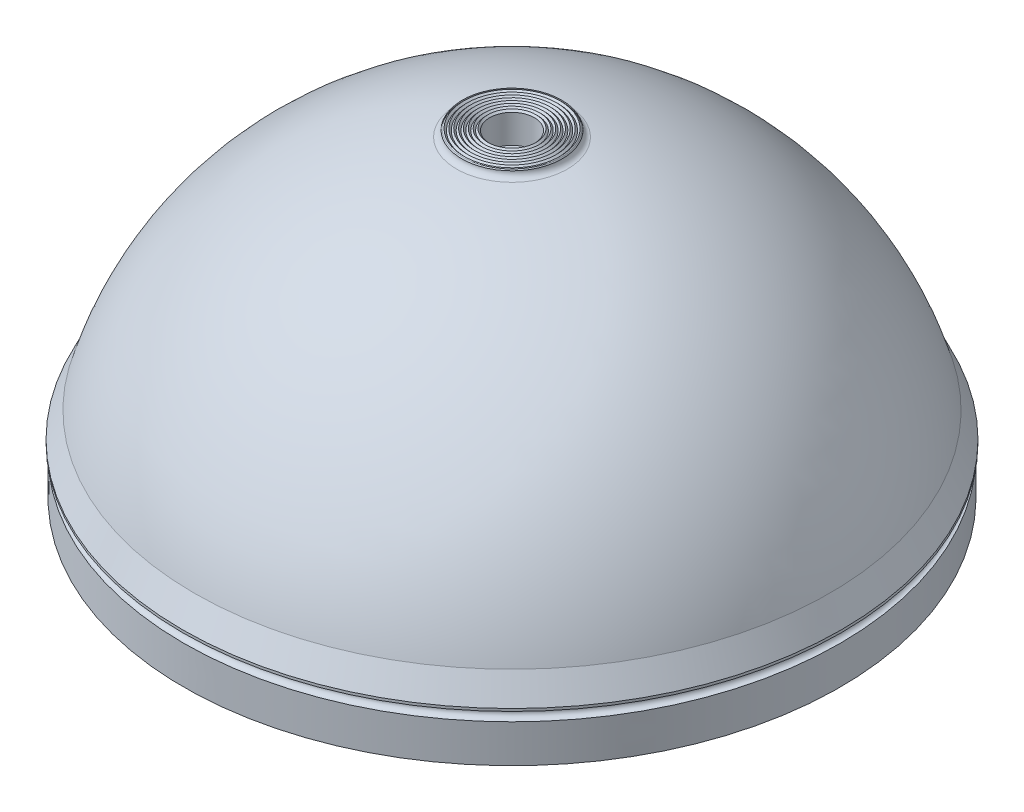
ISO-10303-21;
HEADER;
FILE_DESCRIPTION(('STEP AP214'),'2;1');
FILE_NAME('part.step','',(''),(''),'','','');
FILE_SCHEMA(('AUTOMOTIVE_DESIGN { 1 0 10303 214 1 1 1 1 }'));
ENDSEC;
DATA;
#1=APPLICATION_CONTEXT('core data for automotive mechanical design processes');
#2=APPLICATION_PROTOCOL_DEFINITION('international standard','automotive_design',2000,#1);
#3=PRODUCT_CONTEXT('',#1,'mechanical');
#4=PRODUCT('Part','Part','',(#3));
#5=PRODUCT_RELATED_PRODUCT_CATEGORY('part','',(#4));
#6=PRODUCT_DEFINITION_FORMATION('','',#4);
#7=PRODUCT_DEFINITION_CONTEXT('part definition',#1,'design');
#8=PRODUCT_DEFINITION('design','',#6,#7);
#9=PRODUCT_DEFINITION_SHAPE('','',#8);
#10=(LENGTH_UNIT() NAMED_UNIT(*) SI_UNIT(.MILLI.,.METRE.));
#11=(NAMED_UNIT(*) PLANE_ANGLE_UNIT() SI_UNIT($,.RADIAN.));
#12=(NAMED_UNIT(*) SI_UNIT($,.STERADIAN.) SOLID_ANGLE_UNIT());
#13=UNCERTAINTY_MEASURE_WITH_UNIT(LENGTH_MEASURE(1.E-05),#10,'distance_accuracy_value','');
#14=(GEOMETRIC_REPRESENTATION_CONTEXT(3) GLOBAL_UNCERTAINTY_ASSIGNED_CONTEXT((#13)) GLOBAL_UNIT_ASSIGNED_CONTEXT((#10,
#11,#12)) REPRESENTATION_CONTEXT('',''));
#15=CARTESIAN_POINT('',(0.,0.,0.));
#16=DIRECTION('',(0.,0.,1.));
#17=DIRECTION('',(1.,0.,0.));
#18=AXIS2_PLACEMENT_3D('',#15,#16,#17);
#19=CARTESIAN_POINT('',(0.,0.,0.));
#20=DIRECTION('',(0.,-1.,0.));
#21=DIRECTION('',(0.,0.,-1.));
#22=AXIS2_PLACEMENT_3D('',#19,#20,#21);
#23=CYLINDRICAL_SURFACE('',#22,5.6134);
#24=CARTESIAN_POINT('',(0.,75.946,0.));
#25=DIRECTION('',(0.,-1.,0.));
#26=DIRECTION('',(0.,0.,-1.));
#27=AXIS2_PLACEMENT_3D('',#24,#25,#26);
#28=CIRCLE('',#27,5.6134);
#29=CARTESIAN_POINT('',(0.,75.946,-5.6134));
#30=VERTEX_POINT('',#29);
#31=EDGE_CURVE('E298',#30,#30,#28,.T.);
#32=ORIENTED_EDGE('',*,*,#31,.T.);
#33=EDGE_LOOP('',(#32));
#34=FACE_BOUND('',#33,.T.);
#35=CARTESIAN_POINT('',(0.,83.1342,0.));
#36=DIRECTION('',(0.,-1.,0.));
#37=DIRECTION('',(0.,0.,-1.));
#38=AXIS2_PLACEMENT_3D('',#35,#36,#37);
#39=CIRCLE('',#38,5.6134);
#40=CARTESIAN_POINT('',(0.,83.1342,-5.6134));
#41=VERTEX_POINT('',#40);
#42=EDGE_CURVE('E105',#41,#41,#39,.T.);
#43=ORIENTED_EDGE('',*,*,#42,.F.);
#44=EDGE_LOOP('',(#43));
#45=FACE_BOUND('',#44,.T.);
#46=ADVANCED_FACE('F30',(#34,#45),#23,.F.);
#47=CARTESIAN_POINT('',(0.,0.,0.));
#48=DIRECTION('',(0.,-1.,0.));
#49=DIRECTION('',(0.,0.,-1.));
#50=AXIS2_PLACEMENT_3D('',#47,#48,#49);
#51=CONICAL_SURFACE('',#50,72.0598,0.522328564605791);
#52=CARTESIAN_POINT('',(0.,0.,0.));
#53=DIRECTION('',(0.,-1.,0.));
#54=DIRECTION('',(0.,0.,-1.));
#55=AXIS2_PLACEMENT_3D('',#52,#53,#54);
#56=CIRCLE('',#55,72.0598);
#57=CARTESIAN_POINT('',(0.,0.,-72.0598));
#58=VERTEX_POINT('',#57);
#59=EDGE_CURVE('E256',#58,#58,#56,.T.);
#60=ORIENTED_EDGE('',*,*,#59,.T.);
#61=EDGE_LOOP('',(#60));
#62=FACE_BOUND('',#61,.T.);
#63=CARTESIAN_POINT('',(47.1878148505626,3.86100000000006,-51.4834198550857));
#64=CARTESIAN_POINT('',(47.2379953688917,3.76783129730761,-51.5101794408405));
#65=CARTESIAN_POINT('',(47.289228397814,3.67490203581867,-51.5357775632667));
#66=CARTESIAN_POINT('',(47.3938690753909,3.48960175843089,-51.5845123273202));
#67=CARTESIAN_POINT('',(47.4472771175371,3.39723084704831,-51.6076485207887));
#68=CARTESIAN_POINT('',(47.6112207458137,3.12048317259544,-51.6732946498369));
#69=CARTESIAN_POINT('',(47.7251264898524,2.93712310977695,-51.7118532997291));
#70=CARTESIAN_POINT('',(47.9634702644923,2.57282568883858,-51.7770926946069));
#71=CARTESIAN_POINT('',(48.0879916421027,2.39192350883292,-51.8036666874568));
#72=CARTESIAN_POINT('',(48.3473365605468,2.03628128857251,-51.8420044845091));
#73=CARTESIAN_POINT('',(48.4821424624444,1.86153141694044,-51.8537930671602));
#74=CARTESIAN_POINT('',(48.6777874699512,1.62444033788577,-51.857442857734));
#75=CARTESIAN_POINT('',(48.7338617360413,1.55824635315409,-51.8570560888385));
#76=CARTESIAN_POINT('',(48.8478194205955,1.42753796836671,-51.8531464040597));
#77=CARTESIAN_POINT('',(48.905702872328,1.36302359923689,-51.8496234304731));
#78=CARTESIAN_POINT('',(49.0822082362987,1.17240125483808,-51.833861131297));
#79=CARTESIAN_POINT('',(49.2036904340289,1.04920757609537,-51.8164285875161));
#80=CARTESIAN_POINT('',(49.3923215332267,0.872607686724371,-51.7771572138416));
#81=CARTESIAN_POINT('',(49.4566856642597,0.81477386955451,-51.7617424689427));
#82=CARTESIAN_POINT('',(49.5872683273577,0.702884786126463,-51.7259222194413));
#83=CARTESIAN_POINT('',(49.6534872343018,0.648830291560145,-51.7055156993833));
#84=CARTESIAN_POINT('',(49.8543738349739,0.493959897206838,-51.6359649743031));
#85=CARTESIAN_POINT('',(49.9918343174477,0.39989667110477,-51.5783840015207));
#86=CARTESIAN_POINT('',(50.2127205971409,0.273271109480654,-51.4651183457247));
#87=CARTESIAN_POINT('',(50.2952862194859,0.231280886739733,-51.4182638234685));
#88=CARTESIAN_POINT('',(50.4596544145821,0.16012349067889,-51.3144339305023));
#89=CARTESIAN_POINT('',(50.5414576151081,0.130944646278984,-51.2574678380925));
#90=CARTESIAN_POINT('',(50.7024405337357,0.0877748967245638,-51.1332374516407));
#91=CARTESIAN_POINT('',(50.7815925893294,0.0739130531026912,-51.0658910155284));
#92=CARTESIAN_POINT('',(50.9334195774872,0.0633640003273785,-50.9230478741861));
#93=CARTESIAN_POINT('',(51.0060973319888,0.0666692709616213,-50.8475547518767));
#94=CARTESIAN_POINT('',(51.1353185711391,0.0888098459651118,-50.6994795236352));
#95=CARTESIAN_POINT('',(51.1927541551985,0.10599074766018,-50.6274139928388));
#96=CARTESIAN_POINT('',(51.2995241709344,0.152327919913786,-50.4812009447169));
#97=CARTESIAN_POINT('',(51.3488540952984,0.181490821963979,-50.4070522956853));
#98=CARTESIAN_POINT('',(51.4582214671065,0.264155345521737,-50.2273681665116));
#99=CARTESIAN_POINT('',(51.5141189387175,0.322735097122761,-50.1216651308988));
#100=CARTESIAN_POINT('',(51.611015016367,0.454683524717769,-49.9126852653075));
#101=CARTESIAN_POINT('',(51.6519780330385,0.528086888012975,-49.8094147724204));
#102=CARTESIAN_POINT('',(51.7143538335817,0.669921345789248,-49.6267677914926));
#103=CARTESIAN_POINT('',(51.7380261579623,0.736498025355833,-49.5466816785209));
#104=CARTESIAN_POINT('',(51.7782491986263,0.87491835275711,-49.3892701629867));
#105=CARTESIAN_POINT('',(51.7947953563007,0.946765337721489,-49.3119465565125));
#106=CARTESIAN_POINT('',(51.8217181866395,1.09464302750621,-49.1600448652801));
#107=CARTESIAN_POINT('',(51.832083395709,1.17068122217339,-49.0854721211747));
#108=CARTESIAN_POINT('',(51.84738867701,1.32597891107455,-48.939157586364));
#109=CARTESIAN_POINT('',(51.8523267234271,1.40523959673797,-48.8674168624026));
#110=CARTESIAN_POINT('',(51.8595886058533,1.63411125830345,-48.6674490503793));
#111=CARTESIAN_POINT('',(51.8562137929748,1.78678391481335,-48.5425019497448));
#112=CARTESIAN_POINT('',(51.83637952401,2.09803417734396,-48.3012354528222));
#113=CARTESIAN_POINT('',(51.8199082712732,2.25661698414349,-48.1849239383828));
#114=CARTESIAN_POINT('',(51.7759866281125,2.57795034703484,-47.9603254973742));
#115=CARTESIAN_POINT('',(51.7485313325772,2.74070273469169,-47.8520421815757));
#116=CARTESIAN_POINT('',(51.6841845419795,3.06905620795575,-47.6430925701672));
#117=CARTESIAN_POINT('',(51.647297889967,3.23465579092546,-47.5424223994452));
#118=CARTESIAN_POINT('',(51.5874400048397,3.4776148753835,-47.4008805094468));
#119=CARTESIAN_POINT('',(51.5677607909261,3.55415958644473,-47.3571679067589));
#120=CARTESIAN_POINT('',(51.5267886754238,3.70741581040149,-47.2713385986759));
#121=CARTESIAN_POINT('',(51.5055004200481,3.78412626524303,-47.2292177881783));
#122=CARTESIAN_POINT('',(51.4834198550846,3.86100000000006,-47.1878148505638));
#123=B_SPLINE_CURVE_WITH_KNOTS('',3,(#63,#64,#65,#66,#67,#68,#69,#70,#71,#72,#73,#74,#75,#76,
#77,#78,#79,#80,#81,#82,#83,#84,#85,#86,#87,#88,#89,#90,#91,#92,#93,#94,#95,#96,#97,#98,#99,
#100,#101,#102,#103,#104,#105,#106,#107,#108,#109,#110,#111,#112,#113,#114,#115,#116,#117,#118,
#119,#120,#121,#122),.UNSPECIFIED.,.F.,.F.,(4,2,2,2,2,2,2,2,2,2,2,2,2,2,2,2,2,2,2,2,2,2,2,2,2,2,
2,2,2,4),(0.,0.327436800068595,0.654933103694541,1.31221108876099,1.97523336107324,
2.6371430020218,2.89732083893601,3.15750346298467,3.67784375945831,3.94129930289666,
4.20480848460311,4.72948727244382,5.03987977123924,5.34998891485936,5.66269158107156,
5.97525727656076,6.25524812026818,6.53539413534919,6.93260997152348,7.33076629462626,
7.65073166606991,7.97090141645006,8.29166314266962,8.61254456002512,9.20350790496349,
9.79500416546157,10.3867648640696,10.9782222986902,11.2491505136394,11.5193242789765),.UNSPECIFIED.);
#124=CARTESIAN_POINT('',(47.1879225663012,3.8608,-51.4834773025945));
#125=VERTEX_POINT('',#124);
#126=CARTESIAN_POINT('',(51.4834773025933,3.8608,-47.1879225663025));
#127=VERTEX_POINT('',#126);
#128=EDGE_CURVE('E103',#125,#127,#123,.T.);
#129=ORIENTED_EDGE('',*,*,#128,.F.);
#130=CARTESIAN_POINT('',(0.,3.8608,0.));
#131=DIRECTION('',(0.,-1.,0.));
#132=DIRECTION('',(0.,0.,-1.));
#133=AXIS2_PLACEMENT_3D('',#130,#131,#132);
#134=CIRCLE('',#133,69.8373);
#135=CARTESIAN_POINT('',(3.03741588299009,3.8608,-69.7712159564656));
#136=VERTEX_POINT('',#135);
#137=EDGE_CURVE('E11',#136,#125,#134,.T.);
#138=ORIENTED_EDGE('',*,*,#137,.F.);
#139=CARTESIAN_POINT('',(-3.03745142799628,3.861,-69.7710991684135));
#140=CARTESIAN_POINT('',(-3.02089032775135,3.76783129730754,-69.8255040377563));
#141=CARTESIAN_POINT('',(-3.00276371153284,3.67490203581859,-69.8798318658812));
#142=CARTESIAN_POINT('',(-2.96323226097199,3.48960175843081,-69.9882846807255));
#143=CARTESIAN_POINT('',(-2.94182683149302,3.39723084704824,-70.0424096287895));
#144=CARTESIAN_POINT('',(-2.87232000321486,3.12048317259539,-70.2047541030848));
#145=CARTESIAN_POINT('',(-2.81904156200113,2.93712310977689,-70.3125627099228));
#146=CARTESIAN_POINT('',(-2.69663828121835,2.57282568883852,-70.5272284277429));
#147=CARTESIAN_POINT('',(-2.62737902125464,2.39192350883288,-70.6340689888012));
#148=CARTESIAN_POINT('',(-2.47110338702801,2.03628128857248,-70.8445624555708));
#149=CARTESIAN_POINT('',(-2.38411700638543,1.86153141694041,-70.9482204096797));
#150=CARTESIAN_POINT('',(-2.24835588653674,1.62444033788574,-71.0891431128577));
#151=CARTESIAN_POINT('',(-2.20843190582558,1.55824635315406,-71.1285201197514));
#152=CARTESIAN_POINT('',(-2.12508708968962,1.42753796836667,-71.2063358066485));
#153=CARTESIAN_POINT('',(-2.08166618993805,1.36302359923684,-71.244774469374));
#154=CARTESIAN_POINT('',(-1.94571242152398,1.17240125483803,-71.358436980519));
#155=CARTESIAN_POINT('',(-1.84748486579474,1.04920757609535,-71.4320111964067));
#156=CARTESIAN_POINT('',(-1.68633348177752,0.872607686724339,-71.5376244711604));
#157=CARTESIAN_POINT('',(-1.62992129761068,0.814773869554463,-71.5722369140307));
#158=CARTESIAN_POINT('',(-1.51225666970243,0.702884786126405,-71.6392440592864));
#159=CARTESIAN_POINT('',(-1.45100324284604,0.648830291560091,-71.6716383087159));
#160=CARTESIAN_POINT('',(-1.25977517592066,0.493959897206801,-71.76450679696));
#161=CARTESIAN_POINT('',(-1.1218600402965,0.399896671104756,-71.8209901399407));
#162=CARTESIAN_POINT('',(-0.88557894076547,0.27327110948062,-71.8970894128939));
#163=CARTESIAN_POINT('',(-0.794065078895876,0.23128088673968,-71.9223409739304));
#164=CARTESIAN_POINT('',(-0.604420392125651,0.160123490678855,-71.965148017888));
#165=CARTESIAN_POINT('',(-0.506295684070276,0.130944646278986,-71.9827105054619));
#166=CARTESIAN_POINT('',(-0.304619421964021,0.0877748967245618,-72.0086984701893));
#167=CARTESIAN_POINT('',(-0.201029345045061,0.0739130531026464,-72.0170463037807));
#168=CARTESIAN_POINT('',(0.00733390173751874,0.0633640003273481,-72.0233988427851));
#169=CARTESIAN_POINT('',(0.112106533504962,0.0666692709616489,-72.0214080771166));
#170=CARTESIAN_POINT('',(0.308184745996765,0.0888098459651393,-72.0080762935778));
#171=CARTESIAN_POINT('',(0.399755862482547,0.105990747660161,-71.9977313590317));
#172=CARTESIAN_POINT('',(0.578641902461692,0.152327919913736,-71.969840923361));
#173=CARTESIAN_POINT('',(0.665954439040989,0.181490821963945,-71.9522914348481));
#174=CARTESIAN_POINT('',(0.870344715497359,0.264155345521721,-71.9025699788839));
#175=CARTESIAN_POINT('',(0.984613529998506,0.322735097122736,-71.8673521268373));
#176=CARTESIAN_POINT('',(1.20090048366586,0.454683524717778,-71.7880969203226));
#177=CARTESIAN_POINT('',(1.30288897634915,0.528086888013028,-71.7440388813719));
#178=CARTESIAN_POINT('',(1.47614624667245,0.669921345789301,-71.6589943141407));
#179=CARTESIAN_POINT('',(1.54951454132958,0.736498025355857,-71.6191037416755));
#180=CARTESIAN_POINT('',(1.68926327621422,0.874918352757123,-71.5362389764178));
#181=CARTESIAN_POINT('',(1.75563922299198,0.946765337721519,-71.4932628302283));
#182=CARTESIAN_POINT('',(1.88208725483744,1.09464302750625,-71.4048894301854));
#183=CARTESIAN_POINT('',(1.94214745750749,1.17068122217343,-71.3594878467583));
#184=CARTESIAN_POINT('',(2.05642992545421,1.32597891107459,-71.2668503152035));
#185=CARTESIAN_POINT('',(2.11065000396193,1.40523959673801,-71.2196136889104));
#186=CARTESIAN_POINT('',(2.25718352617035,1.63411125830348,-71.0833500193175));
#187=CARTESIAN_POINT('',(2.34314811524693,1.78678391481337,-70.9926127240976));
#188=CARTESIAN_POINT('',(2.49972434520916,2.09803417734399,-70.8079866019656));
#189=CARTESIAN_POINT('',(2.57032207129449,2.25661698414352,-70.7140950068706));
#190=CARTESIAN_POINT('',(2.69807986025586,2.57795034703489,-70.5242226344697));
#191=CARTESIAN_POINT('',(2.75523390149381,2.74070273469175,-70.4282409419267));
#192=CARTESIAN_POINT('',(2.8574835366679,3.06905620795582,-70.2349912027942));
#193=CARTESIAN_POINT('',(2.90258529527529,3.23465579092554,-70.1377238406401));
#194=CARTESIAN_POINT('',(2.96034460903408,3.47761487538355,-69.9953126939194));
#195=CARTESIAN_POINT('',(2.97733878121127,3.55415958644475,-69.9504879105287));
#196=CARTESIAN_POINT('',(3.00905760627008,3.70741581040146,-69.8608257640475));
#197=CARTESIAN_POINT('',(3.02378844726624,3.78412626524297,-69.8159887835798));
#198=CARTESIAN_POINT('',(3.03745142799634,3.86099999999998,-69.7710991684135));
#199=B_SPLINE_CURVE_WITH_KNOTS('',3,(#139,#140,#141,#142,#143,#144,#145,#146,#147,#148,#149,
#150,#151,#152,#153,#154,#155,#156,#157,#158,#159,#160,#161,#162,#163,#164,#165,#166,#167,#168,
#169,#170,#171,#172,#173,#174,#175,#176,#177,#178,#179,#180,#181,#182,#183,#184,#185,#186,#187,
#188,#189,#190,#191,#192,#193,#194,#195,#196,#197,#198),.UNSPECIFIED.,.F.,.F.,(4,2,2,2,2,2,2,2,
2,2,2,2,2,2,2,2,2,2,2,2,2,2,2,2,2,2,2,2,2,4),(0.,0.327436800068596,0.654933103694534,
1.31221108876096,1.9752333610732,2.63714300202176,2.89732083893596,3.15750346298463,
3.67784375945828,3.94129930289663,4.20480848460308,4.7294872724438,5.0398797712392,
5.34998891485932,5.66269158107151,5.97525727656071,6.25524812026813,6.53539413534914,
6.93260997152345,7.33076629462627,7.65073166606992,7.97090141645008,8.29166314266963,
8.61254456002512,9.20350790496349,9.79500416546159,10.3867648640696,10.9782222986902,
11.2491505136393,11.5193242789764),.UNSPECIFIED.);
#200=CARTESIAN_POINT('',(-3.03741588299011,3.8608,-69.7712159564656));
#201=VERTEX_POINT('',#200);
#202=EDGE_CURVE('E250',#201,#136,#199,.T.);
#203=ORIENTED_EDGE('',*,*,#202,.F.);
#204=CARTESIAN_POINT('',(-47.187922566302,3.8608,-51.4834773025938));
#205=VERTEX_POINT('',#204);
#206=EDGE_CURVE('E117',#205,#201,#134,.T.);
#207=ORIENTED_EDGE('',*,*,#206,.F.);
#208=CARTESIAN_POINT('',(-51.4834198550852,3.86100000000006,-47.1878148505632));
#209=CARTESIAN_POINT('',(-51.51017944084,3.76783129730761,-47.2379953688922));
#210=CARTESIAN_POINT('',(-51.5357775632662,3.67490203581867,-47.2892283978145));
#211=CARTESIAN_POINT('',(-51.5845123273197,3.48960175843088,-47.3938690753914));
#212=CARTESIAN_POINT('',(-51.6076485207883,3.39723084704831,-47.4472771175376));
#213=CARTESIAN_POINT('',(-51.6732946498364,3.12048317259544,-47.6112207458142));
#214=CARTESIAN_POINT('',(-51.7118532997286,2.93712310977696,-47.7251264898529));
#215=CARTESIAN_POINT('',(-51.7770926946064,2.57282568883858,-47.9634702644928));
#216=CARTESIAN_POINT('',(-51.8036666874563,2.39192350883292,-48.0879916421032));
#217=CARTESIAN_POINT('',(-51.8420044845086,2.0362812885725,-48.3473365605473));
#218=CARTESIAN_POINT('',(-51.8537930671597,1.86153141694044,-48.4821424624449));
#219=CARTESIAN_POINT('',(-51.8574428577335,1.62444033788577,-48.6777874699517));
#220=CARTESIAN_POINT('',(-51.8570560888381,1.55824635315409,-48.7338617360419));
#221=CARTESIAN_POINT('',(-51.8531464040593,1.4275379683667,-48.847819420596));
#222=CARTESIAN_POINT('',(-51.8496234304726,1.36302359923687,-48.9057028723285));
#223=CARTESIAN_POINT('',(-51.8338611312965,1.17240125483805,-49.0822082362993));
#224=CARTESIAN_POINT('',(-51.8164285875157,1.04920757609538,-49.2036904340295));
#225=CARTESIAN_POINT('',(-51.7771572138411,0.87260768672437,-49.3923215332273));
#226=CARTESIAN_POINT('',(-51.7617424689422,0.8147738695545,-49.4566856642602));
#227=CARTESIAN_POINT('',(-51.7259222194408,0.702884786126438,-49.5872683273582));
#228=CARTESIAN_POINT('',(-51.7055156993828,0.648830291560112,-49.6534872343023));
#229=CARTESIAN_POINT('',(-51.6359649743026,0.493959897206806,-49.8543738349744));
#230=CARTESIAN_POINT('',(-51.5783840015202,0.399896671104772,-49.9918343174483));
#231=CARTESIAN_POINT('',(-51.4651183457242,0.273271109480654,-50.2127205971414));
#232=CARTESIAN_POINT('',(-51.4182638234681,0.231280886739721,-50.2952862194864));
#233=CARTESIAN_POINT('',(-51.3144339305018,0.160123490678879,-50.4596544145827));
#234=CARTESIAN_POINT('',(-51.257467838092,0.130944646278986,-50.5414576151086));
#235=CARTESIAN_POINT('',(-51.1332374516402,0.0877748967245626,-50.7024405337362));
#236=CARTESIAN_POINT('',(-51.0658910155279,0.0739130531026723,-50.78159258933));
#237=CARTESIAN_POINT('',(-50.9230478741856,0.0633640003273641,-50.9334195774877));
#238=CARTESIAN_POINT('',(-50.8475547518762,0.0666692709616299,-51.0060973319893));
#239=CARTESIAN_POINT('',(-50.6994795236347,0.0888098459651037,-51.1353185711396));
#240=CARTESIAN_POINT('',(-50.6274139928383,0.105990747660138,-51.1927541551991));
#241=CARTESIAN_POINT('',(-50.4812009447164,0.152327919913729,-51.2995241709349));
#242=CARTESIAN_POINT('',(-50.4070522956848,0.18149082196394,-51.3488540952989));
#243=CARTESIAN_POINT('',(-50.2273681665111,0.264155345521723,-51.458221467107));
#244=CARTESIAN_POINT('',(-50.1216651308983,0.322735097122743,-51.514118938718));
#245=CARTESIAN_POINT('',(-49.912685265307,0.454683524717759,-51.6110150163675));
#246=CARTESIAN_POINT('',(-49.8094147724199,0.528086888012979,-51.651978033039));
#247=CARTESIAN_POINT('',(-49.6267677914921,0.669921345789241,-51.7143538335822));
#248=CARTESIAN_POINT('',(-49.5466816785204,0.736498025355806,-51.7380261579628));
#249=CARTESIAN_POINT('',(-49.3892701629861,0.874918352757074,-51.7782491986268));
#250=CARTESIAN_POINT('',(-49.311946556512,0.946765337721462,-51.7947953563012));
#251=CARTESIAN_POINT('',(-49.1600448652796,1.09464302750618,-51.82171818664));
#252=CARTESIAN_POINT('',(-49.0854721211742,1.17068122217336,-51.8320833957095));
#253=CARTESIAN_POINT('',(-48.9391575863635,1.32597891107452,-51.8473886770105));
#254=CARTESIAN_POINT('',(-48.8674168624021,1.40523959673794,-51.8523267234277));
#255=CARTESIAN_POINT('',(-48.6674490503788,1.63411125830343,-51.8595886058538));
#256=CARTESIAN_POINT('',(-48.5425019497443,1.78678391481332,-51.8562137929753));
#257=CARTESIAN_POINT('',(-48.3012354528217,2.09803417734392,-51.8363795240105));
#258=CARTESIAN_POINT('',(-48.1849239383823,2.25661698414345,-51.8199082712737));
#259=CARTESIAN_POINT('',(-47.9603254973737,2.57795034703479,-51.775986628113));
#260=CARTESIAN_POINT('',(-47.8520421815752,2.74070273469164,-51.7485313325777));
#261=CARTESIAN_POINT('',(-47.6430925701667,3.06905620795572,-51.68418454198));
#262=CARTESIAN_POINT('',(-47.5424223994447,3.23465579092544,-51.6472978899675));
#263=CARTESIAN_POINT('',(-47.4008805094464,3.47761487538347,-51.5874400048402));
#264=CARTESIAN_POINT('',(-47.3571679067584,3.5541595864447,-51.5677607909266));
#265=CARTESIAN_POINT('',(-47.2713385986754,3.70741581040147,-51.5267886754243));
#266=CARTESIAN_POINT('',(-47.2292177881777,3.78412626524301,-51.5055004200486));
#267=CARTESIAN_POINT('',(-47.1878148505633,3.86100000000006,-51.4834198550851));
#268=B_SPLINE_CURVE_WITH_KNOTS('',3,(#208,#209,#210,#211,#212,#213,#214,#215,#216,#217,#218,
#219,#220,#221,#222,#223,#224,#225,#226,#227,#228,#229,#230,#231,#232,#233,#234,#235,#236,#237,
#238,#239,#240,#241,#242,#243,#244,#245,#246,#247,#248,#249,#250,#251,#252,#253,#254,#255,#256,
#257,#258,#259,#260,#261,#262,#263,#264,#265,#266,#267),.UNSPECIFIED.,.F.,.F.,(4,2,2,2,2,2,2,2,
2,2,2,2,2,2,2,2,2,2,2,2,2,2,2,2,2,2,2,2,2,4),(0.,0.327436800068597,0.65493310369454,
1.31221108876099,1.97523336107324,2.63714300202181,2.89732083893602,3.15750346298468,
3.67784375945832,3.94129930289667,4.20480848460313,4.72948727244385,5.03987977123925,
5.34998891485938,5.66269158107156,5.97525727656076,6.25524812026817,6.53539413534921,
6.9326099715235,7.33076629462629,7.65073166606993,7.97090141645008,8.29166314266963,
8.61254456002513,9.20350790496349,9.79500416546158,10.3867648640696,10.9782222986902,
11.2491505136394,11.5193242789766),.UNSPECIFIED.);
#269=CARTESIAN_POINT('',(-51.483477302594,3.8608,-47.1879225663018));
#270=VERTEX_POINT('',#269);
#271=EDGE_CURVE('E227',#270,#205,#268,.T.);
#272=ORIENTED_EDGE('',*,*,#271,.F.);
#273=CARTESIAN_POINT('',(-69.7712159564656,3.8608,-3.03741588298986));
#274=VERTEX_POINT('',#273);
#275=EDGE_CURVE('E125',#274,#270,#134,.T.);
#276=ORIENTED_EDGE('',*,*,#275,.F.);
#277=CARTESIAN_POINT('',(-69.7710991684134,3.861,3.0374514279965));
#278=CARTESIAN_POINT('',(-69.8255040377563,3.76783129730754,3.02089032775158));
#279=CARTESIAN_POINT('',(-69.8798318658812,3.6749020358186,3.00276371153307));
#280=CARTESIAN_POINT('',(-69.9882846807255,3.48960175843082,2.96323226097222));
#281=CARTESIAN_POINT('',(-70.0424096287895,3.39723084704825,2.94182683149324));
#282=CARTESIAN_POINT('',(-70.2047541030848,3.12048317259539,2.87232000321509));
#283=CARTESIAN_POINT('',(-70.3125627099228,2.9371231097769,2.81904156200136));
#284=CARTESIAN_POINT('',(-70.5272284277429,2.57282568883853,2.69663828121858));
#285=CARTESIAN_POINT('',(-70.6340689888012,2.39192350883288,2.62737902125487));
#286=CARTESIAN_POINT('',(-70.8445624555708,2.03628128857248,2.47110338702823));
#287=CARTESIAN_POINT('',(-70.9482204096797,1.86153141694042,2.38411700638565));
#288=CARTESIAN_POINT('',(-71.0891431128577,1.62444033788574,2.24835588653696));
#289=CARTESIAN_POINT('',(-71.1285201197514,1.55824635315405,2.20843190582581));
#290=CARTESIAN_POINT('',(-71.2063358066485,1.42753796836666,2.12508708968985));
#291=CARTESIAN_POINT('',(-71.244774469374,1.36302359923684,2.08166618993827));
#292=CARTESIAN_POINT('',(-71.358436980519,1.17240125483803,1.9457124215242));
#293=CARTESIAN_POINT('',(-71.4320111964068,1.04920757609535,1.84748486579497));
#294=CARTESIAN_POINT('',(-71.5376244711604,0.872607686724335,1.68633348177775));
#295=CARTESIAN_POINT('',(-71.5722369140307,0.814773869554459,1.6299212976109));
#296=CARTESIAN_POINT('',(-71.6392440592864,0.7028847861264,1.51225666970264));
#297=CARTESIAN_POINT('',(-71.6716383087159,0.648830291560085,1.45100324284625));
#298=CARTESIAN_POINT('',(-71.76450679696,0.493959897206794,1.25977517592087));
#299=CARTESIAN_POINT('',(-71.8209901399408,0.399896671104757,1.12186004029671));
#300=CARTESIAN_POINT('',(-71.8970894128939,0.273271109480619,0.88557894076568));
#301=CARTESIAN_POINT('',(-71.9223409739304,0.231280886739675,0.794065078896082));
#302=CARTESIAN_POINT('',(-71.965148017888,0.160123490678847,0.604420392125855));
#303=CARTESIAN_POINT('',(-71.982710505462,0.130944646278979,0.506295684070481));
#304=CARTESIAN_POINT('',(-72.0086984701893,0.0877748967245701,0.304619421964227));
#305=CARTESIAN_POINT('',(-72.0170463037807,0.0739130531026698,0.201029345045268));
#306=CARTESIAN_POINT('',(-72.0233988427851,0.0633640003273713,-0.00733390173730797));
#307=CARTESIAN_POINT('',(-72.0214080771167,0.0666692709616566,-0.112106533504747));
#308=CARTESIAN_POINT('',(-72.0080762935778,0.0888098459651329,-0.308184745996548));
#309=CARTESIAN_POINT('',(-71.9977313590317,0.105990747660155,-0.399755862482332));
#310=CARTESIAN_POINT('',(-71.969840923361,0.152327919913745,-0.578641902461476));
#311=CARTESIAN_POINT('',(-71.9522914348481,0.181490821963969,-0.665954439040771));
#312=CARTESIAN_POINT('',(-71.9025699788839,0.264155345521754,-0.87034471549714));
#313=CARTESIAN_POINT('',(-71.8673521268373,0.322735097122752,-0.984613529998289));
#314=CARTESIAN_POINT('',(-71.7880969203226,0.454683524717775,-1.20090048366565));
#315=CARTESIAN_POINT('',(-71.7440388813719,0.528086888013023,-1.30288897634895));
#316=CARTESIAN_POINT('',(-71.6589943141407,0.669921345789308,-1.47614624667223));
#317=CARTESIAN_POINT('',(-71.6191037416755,0.736498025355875,-1.54951454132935));
#318=CARTESIAN_POINT('',(-71.5362389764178,0.874918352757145,-1.68926327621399));
#319=CARTESIAN_POINT('',(-71.4932628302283,0.946765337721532,-1.75563922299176));
#320=CARTESIAN_POINT('',(-71.4048894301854,1.09464302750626,-1.88208725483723));
#321=CARTESIAN_POINT('',(-71.3594878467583,1.17068122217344,-1.94214745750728));
#322=CARTESIAN_POINT('',(-71.2668503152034,1.32597891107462,-2.05642992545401));
#323=CARTESIAN_POINT('',(-71.2196136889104,1.40523959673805,-2.11065000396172));
#324=CARTESIAN_POINT('',(-71.0833500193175,1.63411125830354,-2.25718352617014));
#325=CARTESIAN_POINT('',(-70.9926127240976,1.78678391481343,-2.34314811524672));
#326=CARTESIAN_POINT('',(-70.8079866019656,2.09803417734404,-2.49972434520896));
#327=CARTESIAN_POINT('',(-70.7140950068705,2.25661698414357,-2.57032207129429));
#328=CARTESIAN_POINT('',(-70.5242226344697,2.57795034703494,-2.69807986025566));
#329=CARTESIAN_POINT('',(-70.4282409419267,2.74070273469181,-2.7552339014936));
#330=CARTESIAN_POINT('',(-70.2349912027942,3.06905620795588,-2.85748353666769));
#331=CARTESIAN_POINT('',(-70.1377238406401,3.23465579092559,-2.90258529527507));
#332=CARTESIAN_POINT('',(-69.9953126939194,3.47761487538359,-2.96034460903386));
#333=CARTESIAN_POINT('',(-69.9504879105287,3.55415958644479,-2.97733878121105));
#334=CARTESIAN_POINT('',(-69.8608257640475,3.70741581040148,-3.00905760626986));
#335=CARTESIAN_POINT('',(-69.8159887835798,3.78412626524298,-3.02378844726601));
#336=CARTESIAN_POINT('',(-69.7710991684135,3.86099999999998,-3.0374514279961));
#337=B_SPLINE_CURVE_WITH_KNOTS('',3,(#277,#278,#279,#280,#281,#282,#283,#284,#285,#286,#287,
#288,#289,#290,#291,#292,#293,#294,#295,#296,#297,#298,#299,#300,#301,#302,#303,#304,#305,#306,
#307,#308,#309,#310,#311,#312,#313,#314,#315,#316,#317,#318,#319,#320,#321,#322,#323,#324,#325,
#326,#327,#328,#329,#330,#331,#332,#333,#334,#335,#336),.UNSPECIFIED.,.F.,.F.,(4,2,2,2,2,2,2,2,
2,2,2,2,2,2,2,2,2,2,2,2,2,2,2,2,2,2,2,2,2,4),(0.,0.327436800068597,0.654933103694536,
1.31221108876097,1.9752333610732,2.63714300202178,2.89732083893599,3.15750346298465,
3.6778437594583,3.94129930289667,4.20480848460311,4.72948727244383,5.03987977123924,
5.34998891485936,5.66269158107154,5.97525727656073,6.25524812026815,6.53539413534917,
6.93260997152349,7.33076629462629,7.65073166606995,7.97090141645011,8.29166314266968,
8.61254456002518,9.20350790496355,9.79500416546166,10.3867648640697,10.9782222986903,
11.2491505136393,11.5193242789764),.UNSPECIFIED.);
#338=CARTESIAN_POINT('',(-69.7712159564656,3.8608,3.03741588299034));
#339=VERTEX_POINT('',#338);
#340=EDGE_CURVE('E218',#339,#274,#337,.T.);
#341=ORIENTED_EDGE('',*,*,#340,.F.);
#342=CARTESIAN_POINT('',(-51.4834773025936,3.8608,47.1879225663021));
#343=VERTEX_POINT('',#342);
#344=EDGE_CURVE('E130',#343,#339,#134,.T.);
#345=ORIENTED_EDGE('',*,*,#344,.F.);
#346=CARTESIAN_POINT('',(-47.187814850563,3.86100000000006,51.4834198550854));
#347=CARTESIAN_POINT('',(-47.237995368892,3.76783129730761,51.5101794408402));
#348=CARTESIAN_POINT('',(-47.2892283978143,3.67490203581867,51.5357775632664));
#349=CARTESIAN_POINT('',(-47.3938690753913,3.48960175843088,51.5845123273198));
#350=CARTESIAN_POINT('',(-47.4472771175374,3.3972308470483,51.6076485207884));
#351=CARTESIAN_POINT('',(-47.6112207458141,3.12048317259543,51.6732946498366));
#352=CARTESIAN_POINT('',(-47.7251264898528,2.93712310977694,51.7118532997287));
#353=CARTESIAN_POINT('',(-47.9634702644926,2.57282568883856,51.7770926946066));
#354=CARTESIAN_POINT('',(-48.0879916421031,2.3919235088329,51.8036666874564));
#355=CARTESIAN_POINT('',(-48.3473365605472,2.03628128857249,51.8420044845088));
#356=CARTESIAN_POINT('',(-48.4821424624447,1.86153141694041,51.8537930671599));
#357=CARTESIAN_POINT('',(-48.6777874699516,1.62444033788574,51.8574428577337));
#358=CARTESIAN_POINT('',(-48.7338617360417,1.55824635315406,51.8570560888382));
#359=CARTESIAN_POINT('',(-48.8478194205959,1.42753796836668,51.8531464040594));
#360=CARTESIAN_POINT('',(-48.9057028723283,1.36302359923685,51.8496234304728));
#361=CARTESIAN_POINT('',(-49.0822082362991,1.17240125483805,51.8338611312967));
#362=CARTESIAN_POINT('',(-49.2036904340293,1.04920757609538,51.8164285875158));
#363=CARTESIAN_POINT('',(-49.3923215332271,0.872607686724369,51.7771572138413));
#364=CARTESIAN_POINT('',(-49.45668566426,0.814773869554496,51.7617424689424));
#365=CARTESIAN_POINT('',(-49.587268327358,0.702884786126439,51.7259222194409));
#366=CARTESIAN_POINT('',(-49.6534872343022,0.648830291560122,51.7055156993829));
#367=CARTESIAN_POINT('',(-49.8543738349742,0.493959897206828,51.6359649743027));
#368=CARTESIAN_POINT('',(-49.9918343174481,0.39989667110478,51.5783840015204));
#369=CARTESIAN_POINT('',(-50.2127205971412,0.273271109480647,51.4651183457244));
#370=CARTESIAN_POINT('',(-50.2952862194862,0.231280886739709,51.4182638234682));
#371=CARTESIAN_POINT('',(-50.4596544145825,0.160123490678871,51.314433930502));
#372=CARTESIAN_POINT('',(-50.5414576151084,0.130944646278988,51.2574678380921));
#373=CARTESIAN_POINT('',(-50.702440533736,0.0877748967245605,51.1332374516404));
#374=CARTESIAN_POINT('',(-50.7815925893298,0.0739130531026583,51.0658910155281));
#375=CARTESIAN_POINT('',(-50.9334195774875,0.0633640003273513,50.9230478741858));
#376=CARTESIAN_POINT('',(-51.0060973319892,0.0666692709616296,50.8475547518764));
#377=CARTESIAN_POINT('',(-51.1353185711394,0.0888098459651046,50.6994795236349));
#378=CARTESIAN_POINT('',(-51.1927541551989,0.105990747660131,50.6274139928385));
#379=CARTESIAN_POINT('',(-51.2995241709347,0.152327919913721,50.4812009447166));
#380=CARTESIAN_POINT('',(-51.3488540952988,0.181490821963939,50.407052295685));
#381=CARTESIAN_POINT('',(-51.4582214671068,0.264155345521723,50.2273681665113));
#382=CARTESIAN_POINT('',(-51.5141189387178,0.322735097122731,50.1216651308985));
#383=CARTESIAN_POINT('',(-51.6110150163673,0.454683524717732,49.9126852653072));
#384=CARTESIAN_POINT('',(-51.6519780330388,0.528086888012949,49.8094147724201));
#385=CARTESIAN_POINT('',(-51.714353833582,0.669921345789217,49.6267677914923));
#386=CARTESIAN_POINT('',(-51.7380261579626,0.736498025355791,49.5466816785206));
#387=CARTESIAN_POINT('',(-51.7782491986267,0.874918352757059,49.3892701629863));
#388=CARTESIAN_POINT('',(-51.794795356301,0.946765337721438,49.3119465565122));
#389=CARTESIAN_POINT('',(-51.8217181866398,1.09464302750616,49.1600448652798));
#390=CARTESIAN_POINT('',(-51.8320833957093,1.17068122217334,49.0854721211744));
#391=CARTESIAN_POINT('',(-51.8473886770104,1.3259789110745,48.9391575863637));
#392=CARTESIAN_POINT('',(-51.8523267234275,1.40523959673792,48.8674168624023));
#393=CARTESIAN_POINT('',(-51.8595886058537,1.63411125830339,48.667449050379));
#394=CARTESIAN_POINT('',(-51.8562137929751,1.78678391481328,48.5425019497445));
#395=CARTESIAN_POINT('',(-51.8363795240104,2.09803417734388,48.3012354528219));
#396=CARTESIAN_POINT('',(-51.8199082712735,2.2566169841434,48.1849239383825));
#397=CARTESIAN_POINT('',(-51.7759866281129,2.57795034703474,47.9603254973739));
#398=CARTESIAN_POINT('',(-51.7485313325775,2.7407027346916,47.8520421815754));
#399=CARTESIAN_POINT('',(-51.6841845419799,3.06905620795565,47.6430925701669));
#400=CARTESIAN_POINT('',(-51.6472978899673,3.23465579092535,47.5424223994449));
#401=CARTESIAN_POINT('',(-51.5874400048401,3.4776148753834,47.4008805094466));
#402=CARTESIAN_POINT('',(-51.5677607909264,3.55415958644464,47.3571679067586));
#403=CARTESIAN_POINT('',(-51.5267886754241,3.70741581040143,47.2713385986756));
#404=CARTESIAN_POINT('',(-51.5055004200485,3.78412626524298,47.229217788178));
#405=CARTESIAN_POINT('',(-51.4834198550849,3.86100000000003,47.1878148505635));
#406=B_SPLINE_CURVE_WITH_KNOTS('',3,(#346,#347,#348,#349,#350,#351,#352,#353,#354,#355,#356,
#357,#358,#359,#360,#361,#362,#363,#364,#365,#366,#367,#368,#369,#370,#371,#372,#373,#374,#375,
#376,#377,#378,#379,#380,#381,#382,#383,#384,#385,#386,#387,#388,#389,#390,#391,#392,#393,#394,
#395,#396,#397,#398,#399,#400,#401,#402,#403,#404,#405),.UNSPECIFIED.,.F.,.F.,(4,2,2,2,2,2,2,2,
2,2,2,2,2,2,2,2,2,2,2,2,2,2,2,2,2,2,2,2,2,4),(0.,0.327436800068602,0.654933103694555,
1.31221108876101,1.97523336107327,2.63714300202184,2.89732083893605,3.1575034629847,
3.67784375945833,3.94129930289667,4.20480848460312,4.72948727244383,5.03987977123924,
5.34998891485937,5.66269158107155,5.97525727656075,6.25524812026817,6.53539413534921,
6.93260997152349,7.33076629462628,7.65073166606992,7.97090141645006,8.29166314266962,
8.61254456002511,9.20350790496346,9.79500416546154,10.3867648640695,10.9782222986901,
11.2491505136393,11.5193242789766),.UNSPECIFIED.);
#407=CARTESIAN_POINT('',(-47.1879225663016,3.8608,51.4834773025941));
#408=VERTEX_POINT('',#407);
#409=EDGE_CURVE('E194',#408,#343,#406,.T.);
#410=ORIENTED_EDGE('',*,*,#409,.F.);
#411=CARTESIAN_POINT('',(-3.0374158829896,3.8608,69.7712159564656));
#412=VERTEX_POINT('',#411);
#413=EDGE_CURVE('E132',#412,#408,#134,.T.);
#414=ORIENTED_EDGE('',*,*,#413,.F.);
#415=CARTESIAN_POINT('',(3.03745142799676,3.861,69.7710991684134));
#416=CARTESIAN_POINT('',(3.02089032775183,3.76783129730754,69.8255040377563));
#417=CARTESIAN_POINT('',(3.00276371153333,3.6749020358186,69.8798318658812));
#418=CARTESIAN_POINT('',(2.96323226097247,3.48960175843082,69.9882846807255));
#419=CARTESIAN_POINT('',(2.9418268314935,3.39723084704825,70.0424096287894));
#420=CARTESIAN_POINT('',(2.87232000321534,3.12048317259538,70.2047541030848));
#421=CARTESIAN_POINT('',(2.81904156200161,2.93712310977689,70.3125627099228));
#422=CARTESIAN_POINT('',(2.69663828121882,2.57282568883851,70.5272284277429));
#423=CARTESIAN_POINT('',(2.62737902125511,2.39192350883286,70.6340689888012));
#424=CARTESIAN_POINT('',(2.47110338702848,2.03628128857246,70.8445624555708));
#425=CARTESIAN_POINT('',(2.38411700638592,1.86153141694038,70.9482204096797));
#426=CARTESIAN_POINT('',(2.24835588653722,1.62444033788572,71.0891431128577));
#427=CARTESIAN_POINT('',(2.20843190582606,1.55824635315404,71.1285201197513));
#428=CARTESIAN_POINT('',(2.1250870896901,1.42753796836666,71.2063358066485));
#429=CARTESIAN_POINT('',(2.08166618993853,1.36302359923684,71.244774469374));
#430=CARTESIAN_POINT('',(1.94571242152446,1.17240125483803,71.358436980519));
#431=CARTESIAN_POINT('',(1.84748486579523,1.04920757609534,71.4320111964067));
#432=CARTESIAN_POINT('',(1.686333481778,0.872607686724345,71.5376244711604));
#433=CARTESIAN_POINT('',(1.62992129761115,0.814773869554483,71.5722369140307));
#434=CARTESIAN_POINT('',(1.5122566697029,0.702884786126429,71.6392440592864));
#435=CARTESIAN_POINT('',(1.45100324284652,0.648830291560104,71.6716383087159));
#436=CARTESIAN_POINT('',(1.25977517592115,0.493959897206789,71.76450679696));
#437=CARTESIAN_POINT('',(1.121860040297,0.399896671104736,71.8209901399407));
#438=CARTESIAN_POINT('',(0.88557894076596,0.273271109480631,71.8970894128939));
#439=CARTESIAN_POINT('',(0.794065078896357,0.231280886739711,71.9223409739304));
#440=CARTESIAN_POINT('',(0.604420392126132,0.160123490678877,71.965148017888));
#441=CARTESIAN_POINT('',(0.506295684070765,0.130944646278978,71.9827105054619));
#442=CARTESIAN_POINT('',(0.304619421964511,0.0877748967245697,72.0086984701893));
#443=CARTESIAN_POINT('',(0.201029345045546,0.0739130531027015,72.0170463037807));
#444=CARTESIAN_POINT('',(-0.00733390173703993,0.0633640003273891,72.0233988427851));
#445=CARTESIAN_POINT('',(-0.112106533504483,0.0666692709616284,72.0214080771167));
#446=CARTESIAN_POINT('',(-0.308184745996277,0.088809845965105,72.0080762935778));
#447=CARTESIAN_POINT('',(-0.399755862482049,0.105990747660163,71.9977313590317));
#448=CARTESIAN_POINT('',(-0.578641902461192,0.152327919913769,71.969840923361));
#449=CARTESIAN_POINT('',(-0.665954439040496,0.181490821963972,71.9522914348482));
#450=CARTESIAN_POINT('',(-0.870344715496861,0.264155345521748,71.9025699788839));
#451=CARTESIAN_POINT('',(-0.984613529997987,0.322735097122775,71.8673521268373));
#452=CARTESIAN_POINT('',(-1.20090048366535,0.45468352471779,71.7880969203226));
#453=CARTESIAN_POINT('',(-1.30288897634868,0.528086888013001,71.744038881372));
#454=CARTESIAN_POINT('',(-1.47614624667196,0.669921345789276,71.6589943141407));
#455=CARTESIAN_POINT('',(-1.54951454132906,0.736498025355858,71.6191037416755));
#456=CARTESIAN_POINT('',(-1.6892632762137,0.874918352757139,71.5362389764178));
#457=CARTESIAN_POINT('',(-1.75563922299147,0.946765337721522,71.4932628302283));
#458=CARTESIAN_POINT('',(-1.88208725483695,1.09464302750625,71.4048894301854));
#459=CARTESIAN_POINT('',(-1.942147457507,1.17068122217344,71.3594878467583));
#460=CARTESIAN_POINT('',(-2.05642992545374,1.32597891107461,71.2668503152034));
#461=CARTESIAN_POINT('',(-2.11065000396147,1.40523959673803,71.2196136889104));
#462=CARTESIAN_POINT('',(-2.2571835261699,1.63411125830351,71.0833500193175));
#463=CARTESIAN_POINT('',(-2.34314811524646,1.78678391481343,70.9926127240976));
#464=CARTESIAN_POINT('',(-2.49972434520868,2.09803417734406,70.8079866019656));
#465=CARTESIAN_POINT('',(-2.57032207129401,2.25661698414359,70.7140950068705));
#466=CARTESIAN_POINT('',(-2.6980798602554,2.57795034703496,70.5242226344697));
#467=CARTESIAN_POINT('',(-2.75523390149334,2.74070273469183,70.4282409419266));
#468=CARTESIAN_POINT('',(-2.85748353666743,3.0690562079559,70.2349912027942));
#469=CARTESIAN_POINT('',(-2.90258529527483,3.23465579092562,70.1377238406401));
#470=CARTESIAN_POINT('',(-2.96034460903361,3.47761487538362,69.9953126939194));
#471=CARTESIAN_POINT('',(-2.97733878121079,3.55415958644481,69.9504879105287));
#472=CARTESIAN_POINT('',(-3.0090576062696,3.70741581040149,69.8608257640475));
#473=CARTESIAN_POINT('',(-3.02378844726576,3.78412626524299,69.8159887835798));
#474=CARTESIAN_POINT('',(-3.03745142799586,3.86099999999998,69.7710991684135));
#475=B_SPLINE_CURVE_WITH_KNOTS('',3,(#415,#416,#417,#418,#419,#420,#421,#422,#423,#424,#425,
#426,#427,#428,#429,#430,#431,#432,#433,#434,#435,#436,#437,#438,#439,#440,#441,#442,#443,#444,
#445,#446,#447,#448,#449,#450,#451,#452,#453,#454,#455,#456,#457,#458,#459,#460,#461,#462,#463,
#464,#465,#466,#467,#468,#469,#470,#471,#472,#473,#474),.UNSPECIFIED.,.F.,.F.,(4,2,2,2,2,2,2,2,
2,2,2,2,2,2,2,2,2,2,2,2,2,2,2,2,2,2,2,2,2,4),(0.,0.327436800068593,0.654933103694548,
1.31221108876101,1.97523336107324,2.6371430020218,2.897320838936,3.15750346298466,
3.6778437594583,3.94129930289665,4.2048084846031,4.72948727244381,5.03987977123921,
5.34998891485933,5.66269158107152,5.97525727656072,6.25524812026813,6.53539413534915,
6.93260997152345,7.33076629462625,7.6507316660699,7.97090141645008,8.29166314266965,
8.61254456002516,9.20350790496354,9.79500416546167,10.3867648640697,10.9782222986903,
11.2491505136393,11.5193242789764),.UNSPECIFIED.);
#476=CARTESIAN_POINT('',(3.0374158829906,3.8608,69.7712159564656));
#477=VERTEX_POINT('',#476);
#478=EDGE_CURVE('E162',#477,#412,#475,.T.);
#479=ORIENTED_EDGE('',*,*,#478,.F.);
#480=CARTESIAN_POINT('',(47.1879225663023,3.8608,51.4834773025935));
#481=VERTEX_POINT('',#480);
#482=EDGE_CURVE('E139',#481,#477,#134,.T.);
#483=ORIENTED_EDGE('',*,*,#482,.F.);
#484=CARTESIAN_POINT('',(51.4834198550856,3.86100000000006,47.1878148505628));
#485=CARTESIAN_POINT('',(51.5101794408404,3.76783129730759,47.2379953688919));
#486=CARTESIAN_POINT('',(51.5357775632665,3.67490203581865,47.2892283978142));
#487=CARTESIAN_POINT('',(51.58451232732,3.48960175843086,47.3938690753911));
#488=CARTESIAN_POINT('',(51.6076485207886,3.39723084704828,47.4472771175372));
#489=CARTESIAN_POINT('',(51.6732946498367,3.12048317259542,47.6112207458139));
#490=CARTESIAN_POINT('',(51.7118532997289,2.93712310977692,47.7251264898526));
#491=CARTESIAN_POINT('',(51.7770926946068,2.57282568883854,47.9634702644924));
#492=CARTESIAN_POINT('',(51.8036666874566,2.39192350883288,48.0879916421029));
#493=CARTESIAN_POINT('',(51.8420044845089,2.03628128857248,48.347336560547));
#494=CARTESIAN_POINT('',(51.85379306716,1.86153141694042,48.4821424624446));
#495=CARTESIAN_POINT('',(51.8574428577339,1.62444033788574,48.6777874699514));
#496=CARTESIAN_POINT('',(51.8570560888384,1.55824635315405,48.7338617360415));
#497=CARTESIAN_POINT('',(51.8531464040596,1.42753796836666,48.8478194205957));
#498=CARTESIAN_POINT('',(51.849623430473,1.36302359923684,48.9057028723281));
#499=CARTESIAN_POINT('',(51.8338611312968,1.17240125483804,49.0822082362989));
#500=CARTESIAN_POINT('',(51.816428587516,1.04920757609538,49.2036904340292));
#501=CARTESIAN_POINT('',(51.7771572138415,0.872607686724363,49.3923215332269));
#502=CARTESIAN_POINT('',(51.7617424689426,0.814773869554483,49.4566856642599));
#503=CARTESIAN_POINT('',(51.7259222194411,0.702884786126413,49.5872683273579));
#504=CARTESIAN_POINT('',(51.7055156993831,0.64883029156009,49.653487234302));
#505=CARTESIAN_POINT('',(51.6359649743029,0.493959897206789,49.8543738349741));
#506=CARTESIAN_POINT('',(51.5783840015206,0.399896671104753,49.9918343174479));
#507=CARTESIAN_POINT('',(51.4651183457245,0.273271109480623,50.2127205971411));
#508=CARTESIAN_POINT('',(51.4182638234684,0.231280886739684,50.2952862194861));
#509=CARTESIAN_POINT('',(51.3144339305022,0.160123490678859,50.4596544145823));
#510=CARTESIAN_POINT('',(51.2574678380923,0.13094464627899,50.5414576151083));
#511=CARTESIAN_POINT('',(51.1332374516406,0.0877748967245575,50.7024405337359));
#512=CARTESIAN_POINT('',(51.0658910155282,0.0739130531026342,50.7815925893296));
#513=CARTESIAN_POINT('',(50.923047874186,0.0633640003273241,50.9334195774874));
#514=CARTESIAN_POINT('',(50.8475547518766,0.0666692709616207,51.006097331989));
#515=CARTESIAN_POINT('',(50.699479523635,0.0888098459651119,51.1353185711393));
#516=CARTESIAN_POINT('',(50.6274139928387,0.105990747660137,51.1927541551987));
#517=CARTESIAN_POINT('',(50.4812009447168,0.152327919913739,51.2995241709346));
#518=CARTESIAN_POINT('',(50.4070522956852,0.18149082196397,51.3488540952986));
#519=CARTESIAN_POINT('',(50.2273681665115,0.264155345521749,51.4582214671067));
#520=CARTESIAN_POINT('',(50.1216651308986,0.322735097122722,51.5141189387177));
#521=CARTESIAN_POINT('',(49.9126852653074,0.454683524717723,51.6110150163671));
#522=CARTESIAN_POINT('',(49.8094147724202,0.528086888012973,51.6519780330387));
#523=CARTESIAN_POINT('',(49.6267677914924,0.669921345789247,51.7143538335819));
#524=CARTESIAN_POINT('',(49.5466816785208,0.736498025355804,51.7380261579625));
#525=CARTESIAN_POINT('',(49.3892701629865,0.874918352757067,51.7782491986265));
#526=CARTESIAN_POINT('',(49.3119465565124,0.946765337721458,51.7947953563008));
#527=CARTESIAN_POINT('',(49.1600448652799,1.09464302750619,51.8217181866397));
#528=CARTESIAN_POINT('',(49.0854721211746,1.17068122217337,51.8320833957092));
#529=CARTESIAN_POINT('',(48.9391575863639,1.32597891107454,51.8473886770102));
#530=CARTESIAN_POINT('',(48.8674168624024,1.40523959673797,51.8523267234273));
#531=CARTESIAN_POINT('',(48.6674490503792,1.63411125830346,51.8595886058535));
#532=CARTESIAN_POINT('',(48.5425019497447,1.78678391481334,51.8562137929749));
#533=CARTESIAN_POINT('',(48.301235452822,2.09803417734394,51.8363795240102));
#534=CARTESIAN_POINT('',(48.1849239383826,2.25661698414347,51.8199082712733));
#535=CARTESIAN_POINT('',(47.960325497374,2.57795034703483,51.7759866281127));
#536=CARTESIAN_POINT('',(47.8520421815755,2.74070273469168,51.7485313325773));
#537=CARTESIAN_POINT('',(47.643092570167,3.06905620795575,51.6841845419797));
#538=CARTESIAN_POINT('',(47.542422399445,3.23465579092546,51.6472978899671));
#539=CARTESIAN_POINT('',(47.4008805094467,3.47761487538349,51.5874400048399));
#540=CARTESIAN_POINT('',(47.3571679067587,3.55415958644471,51.5677607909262));
#541=CARTESIAN_POINT('',(47.2713385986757,3.70741581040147,51.526788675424));
#542=CARTESIAN_POINT('',(47.2292177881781,3.78412626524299,51.5055004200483));
#543=CARTESIAN_POINT('',(47.1878148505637,3.86100000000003,51.4834198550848));
#544=B_SPLINE_CURVE_WITH_KNOTS('',3,(#484,#485,#486,#487,#488,#489,#490,#491,#492,#493,#494,
#495,#496,#497,#498,#499,#500,#501,#502,#503,#504,#505,#506,#507,#508,#509,#510,#511,#512,#513,
#514,#515,#516,#517,#518,#519,#520,#521,#522,#523,#524,#525,#526,#527,#528,#529,#530,#531,#532,
#533,#534,#535,#536,#537,#538,#539,#540,#541,#542,#543),.UNSPECIFIED.,.F.,.F.,(4,2,2,2,2,2,2,2,
2,2,2,2,2,2,2,2,2,2,2,2,2,2,2,2,2,2,2,2,2,4),(0.,0.327436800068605,0.654933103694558,
1.31221108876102,1.97523336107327,2.63714300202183,2.89732083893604,3.15750346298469,
3.67784375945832,3.94129930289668,4.20480848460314,4.72948727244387,5.03987977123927,
5.34998891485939,5.66269158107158,5.97525727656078,6.25524812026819,6.53539413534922,
6.93260997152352,7.33076629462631,7.65073166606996,7.97090141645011,8.29166314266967,
8.61254456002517,9.20350790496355,9.79500416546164,10.3867648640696,10.9782222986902,
11.2491505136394,11.5193242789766),.UNSPECIFIED.);
#545=CARTESIAN_POINT('',(51.4834773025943,3.8608,47.1879225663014));
#546=VERTEX_POINT('',#545);
#547=EDGE_CURVE('E155',#546,#481,#544,.T.);
#548=ORIENTED_EDGE('',*,*,#547,.F.);
#549=CARTESIAN_POINT('',(69.7712159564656,3.8608,3.03741588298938));
#550=VERTEX_POINT('',#549);
#551=EDGE_CURVE('E99',#550,#546,#134,.T.);
#552=ORIENTED_EDGE('',*,*,#551,.F.);
#553=CARTESIAN_POINT('',(69.7710991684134,3.861,-3.037451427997));
#554=CARTESIAN_POINT('',(69.8255040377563,3.76783129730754,-3.02089032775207));
#555=CARTESIAN_POINT('',(69.8798318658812,3.6749020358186,-3.00276371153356));
#556=CARTESIAN_POINT('',(69.9882846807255,3.48960175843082,-2.9632322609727));
#557=CARTESIAN_POINT('',(70.0424096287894,3.39723084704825,-2.94182683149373));
#558=CARTESIAN_POINT('',(70.2047541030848,3.12048317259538,-2.87232000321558));
#559=CARTESIAN_POINT('',(70.3125627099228,2.93712310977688,-2.81904156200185));
#560=CARTESIAN_POINT('',(70.5272284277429,2.5728256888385,-2.69663828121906));
#561=CARTESIAN_POINT('',(70.6340689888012,2.39192350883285,-2.62737902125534));
#562=CARTESIAN_POINT('',(70.8445624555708,2.03628128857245,-2.47110338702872));
#563=CARTESIAN_POINT('',(70.9482204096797,1.86153141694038,-2.38411700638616));
#564=CARTESIAN_POINT('',(71.0891431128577,1.62444033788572,-2.24835588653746));
#565=CARTESIAN_POINT('',(71.1285201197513,1.55824635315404,-2.2084319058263));
#566=CARTESIAN_POINT('',(71.2063358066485,1.42753796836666,-2.12508708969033));
#567=CARTESIAN_POINT('',(71.244774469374,1.36302359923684,-2.08166618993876));
#568=CARTESIAN_POINT('',(71.358436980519,1.17240125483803,-1.9457124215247));
#569=CARTESIAN_POINT('',(71.4320111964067,1.04920757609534,-1.84748486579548));
#570=CARTESIAN_POINT('',(71.5376244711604,0.872607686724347,-1.68633348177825));
#571=CARTESIAN_POINT('',(71.5722369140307,0.81477386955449,-1.6299212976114));
#572=CARTESIAN_POINT('',(71.6392440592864,0.702884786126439,-1.51225666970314));
#573=CARTESIAN_POINT('',(71.6716383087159,0.648830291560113,-1.45100324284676));
#574=CARTESIAN_POINT('',(71.76450679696,0.493959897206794,-1.25977517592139));
#575=CARTESIAN_POINT('',(71.8209901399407,0.399896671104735,-1.12186004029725));
#576=CARTESIAN_POINT('',(71.8970894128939,0.273271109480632,-0.88557894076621));
#577=CARTESIAN_POINT('',(71.9223409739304,0.231280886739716,-0.794065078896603));
#578=CARTESIAN_POINT('',(71.965148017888,0.160123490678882,-0.604420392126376));
#579=CARTESIAN_POINT('',(71.9827105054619,0.13094464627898,-0.506295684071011));
#580=CARTESIAN_POINT('',(72.0086984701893,0.0877748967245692,-0.304619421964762));
#581=CARTESIAN_POINT('',(72.0170463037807,0.0739130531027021,-0.201029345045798));
#582=CARTESIAN_POINT('',(72.0233988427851,0.0633640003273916,0.00733390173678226));
#583=CARTESIAN_POINT('',(72.0214080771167,0.0666692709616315,0.112106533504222));
#584=CARTESIAN_POINT('',(72.0080762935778,0.0888098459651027,0.308184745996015));
#585=CARTESIAN_POINT('',(71.9977313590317,0.105990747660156,0.39975586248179));
#586=CARTESIAN_POINT('',(71.969840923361,0.152327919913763,0.578641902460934));
#587=CARTESIAN_POINT('',(71.9522914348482,0.18149082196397,0.665954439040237));
#588=CARTESIAN_POINT('',(71.9025699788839,0.264155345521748,0.870344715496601));
#589=CARTESIAN_POINT('',(71.8673521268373,0.322735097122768,0.98461352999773));
#590=CARTESIAN_POINT('',(71.7880969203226,0.454683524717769,1.2009004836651));
#591=CARTESIAN_POINT('',(71.744038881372,0.528086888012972,1.30288897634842));
#592=CARTESIAN_POINT('',(71.6589943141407,0.66992134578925,1.4761462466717));
#593=CARTESIAN_POINT('',(71.6191037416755,0.736498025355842,1.5495145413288));
#594=CARTESIAN_POINT('',(71.5362389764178,0.874918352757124,1.68926327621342));
#595=CARTESIAN_POINT('',(71.4932628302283,0.946765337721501,1.7556392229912));
#596=CARTESIAN_POINT('',(71.4048894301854,1.09464302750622,1.88208725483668));
#597=CARTESIAN_POINT('',(71.3594878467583,1.1706812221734,1.94214745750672));
#598=CARTESIAN_POINT('',(71.2668503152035,1.32597891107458,2.05642992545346));
#599=CARTESIAN_POINT('',(71.2196136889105,1.405239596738,2.11065000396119));
#600=CARTESIAN_POINT('',(71.0833500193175,1.63411125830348,2.25718352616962));
#601=CARTESIAN_POINT('',(70.9926127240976,1.78678391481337,2.34314811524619));
#602=CARTESIAN_POINT('',(70.8079866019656,2.09803417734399,2.49972434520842));
#603=CARTESIAN_POINT('',(70.7140950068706,2.25661698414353,2.57032207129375));
#604=CARTESIAN_POINT('',(70.5242226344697,2.5779503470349,2.69807986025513));
#605=CARTESIAN_POINT('',(70.4282409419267,2.74070273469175,2.75523390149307));
#606=CARTESIAN_POINT('',(70.2349912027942,3.06905620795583,2.85748353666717));
#607=CARTESIAN_POINT('',(70.1377238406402,3.23465579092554,2.90258529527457));
#608=CARTESIAN_POINT('',(69.9953126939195,3.47761487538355,2.96034460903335));
#609=CARTESIAN_POINT('',(69.9504879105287,3.55415958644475,2.97733878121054));
#610=CARTESIAN_POINT('',(69.8608257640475,3.70741581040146,3.00905760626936));
#611=CARTESIAN_POINT('',(69.8159887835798,3.78412626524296,3.02378844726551));
#612=CARTESIAN_POINT('',(69.7710991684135,3.86099999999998,3.03745142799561));
#613=B_SPLINE_CURVE_WITH_KNOTS('',3,(#553,#554,#555,#556,#557,#558,#559,#560,#561,#562,#563,
#564,#565,#566,#567,#568,#569,#570,#571,#572,#573,#574,#575,#576,#577,#578,#579,#580,#581,#582,
#583,#584,#585,#586,#587,#588,#589,#590,#591,#592,#593,#594,#595,#596,#597,#598,#599,#600,#601,
#602,#603,#604,#605,#606,#607,#608,#609,#610,#611,#612),.UNSPECIFIED.,.F.,.F.,(4,2,2,2,2,2,2,2,
2,2,2,2,2,2,2,2,2,2,2,2,2,2,2,2,2,2,2,2,2,4),(0.,0.327436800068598,0.654933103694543,
1.312211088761,1.97523336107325,2.63714300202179,2.897320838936,3.15750346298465,
3.67784375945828,3.94129930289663,4.20480848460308,4.7294872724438,5.0398797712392,
5.34998891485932,5.6626915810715,5.97525727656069,6.2552481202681,6.53539413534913,
6.93260997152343,7.33076629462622,7.65073166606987,7.97090141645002,8.29166314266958,
8.61254456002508,9.20350790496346,9.79500416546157,10.3867648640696,10.9782222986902,
11.2491505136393,11.5193242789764),.UNSPECIFIED.);
#614=CARTESIAN_POINT('',(69.7712159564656,3.8608,-3.03741588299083));
#615=VERTEX_POINT('',#614);
#616=EDGE_CURVE('E156',#615,#550,#613,.T.);
#617=ORIENTED_EDGE('',*,*,#616,.F.);
#618=EDGE_CURVE('E40',#127,#615,#134,.T.);
#619=ORIENTED_EDGE('',*,*,#618,.F.);
#620=EDGE_LOOP('',(#129,#138,#203,#207,#272,#276,#341,#345,#410,#414,#479,#483,#548,#552,#617,#619));
#621=FACE_BOUND('',#620,.T.);
#622=ADVANCED_FACE('F32',(#62,#621),#51,.F.);
#623=CARTESIAN_POINT('',(0.,0.,0.));
#624=DIRECTION('',(0.,-1.,0.));
#625=DIRECTION('',(0.,0.,-1.));
#626=AXIS2_PLACEMENT_3D('',#623,#624,#625);
#627=CYLINDRICAL_SURFACE('',#626,69.8373);
#628=CARTESIAN_POINT('',(0.,7.87399999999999,0.));
#629=DIRECTION('',(0.,-1.,0.));
#630=DIRECTION('',(0.,0.,-1.));
#631=AXIS2_PLACEMENT_3D('',#628,#629,#630);
#632=CIRCLE('',#631,69.8373);
#633=CARTESIAN_POINT('',(0.,7.87399999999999,-69.8373));
#634=VERTEX_POINT('',#633);
#635=EDGE_CURVE('E120',#634,#634,#632,.T.);
#636=ORIENTED_EDGE('',*,*,#635,.F.);
#637=EDGE_LOOP('',(#636));
#638=FACE_BOUND('',#637,.T.);
#639=ORIENTED_EDGE('',*,*,#137,.T.);
#640=EDGE_CURVE('E39',#125,#127,#134,.T.);
#641=ORIENTED_EDGE('',*,*,#640,.T.);
#642=ORIENTED_EDGE('',*,*,#618,.T.);
#643=EDGE_CURVE('E141',#615,#550,#134,.T.);
#644=ORIENTED_EDGE('',*,*,#643,.T.);
#645=ORIENTED_EDGE('',*,*,#551,.T.);
#646=EDGE_CURVE('E135',#546,#481,#134,.T.);
#647=ORIENTED_EDGE('',*,*,#646,.T.);
#648=ORIENTED_EDGE('',*,*,#482,.T.);
#649=EDGE_CURVE('E134',#477,#412,#134,.T.);
#650=ORIENTED_EDGE('',*,*,#649,.T.);
#651=ORIENTED_EDGE('',*,*,#413,.T.);
#652=EDGE_CURVE('E127',#408,#343,#134,.T.);
#653=ORIENTED_EDGE('',*,*,#652,.T.);
#654=ORIENTED_EDGE('',*,*,#344,.T.);
#655=EDGE_CURVE('E122',#339,#274,#134,.T.);
#656=ORIENTED_EDGE('',*,*,#655,.T.);
#657=ORIENTED_EDGE('',*,*,#275,.T.);
#658=EDGE_CURVE('E121',#270,#205,#134,.T.);
#659=ORIENTED_EDGE('',*,*,#658,.T.);
#660=ORIENTED_EDGE('',*,*,#206,.T.);
#661=EDGE_CURVE('E41',#201,#136,#134,.T.);
#662=ORIENTED_EDGE('',*,*,#661,.T.);
#663=EDGE_LOOP('',(#639,#641,#642,#644,#645,#647,#648,#650,#651,#653,#654,#656,#657,#659,#660,#662));
#664=FACE_BOUND('',#663,.T.);
#665=ADVANCED_FACE('F113',(#638,#664),#627,.F.);
#666=CARTESIAN_POINT('',(-69.8373,7.87399999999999,0.));
#667=DIRECTION('',(0.,-1.,0.));
#668=DIRECTION('',(0.,0.,-1.));
#669=AXIS2_PLACEMENT_3D('',#666,#667,#668);
#670=PLANE('',#669);
#671=CARTESIAN_POINT('',(0.,7.87399999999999,0.));
#672=DIRECTION('',(0.,-1.,0.));
#673=DIRECTION('',(0.,0.,-1.));
#674=AXIS2_PLACEMENT_3D('',#671,#672,#673);
#675=CIRCLE('',#674,71.6026);
#676=CARTESIAN_POINT('',(0.,7.87399999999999,-71.6026));
#677=VERTEX_POINT('',#676);
#678=EDGE_CURVE('E124',#677,#677,#675,.T.);
#679=ORIENTED_EDGE('',*,*,#678,.F.);
#680=EDGE_LOOP('',(#679));
#681=FACE_BOUND('',#680,.T.);
#682=ORIENTED_EDGE('',*,*,#635,.T.);
#683=EDGE_LOOP('',(#682));
#684=FACE_BOUND('',#683,.T.);
#685=ADVANCED_FACE('F342',(#681,#684),#670,.F.);
#686=CARTESIAN_POINT('',(0.,0.,0.));
#687=DIRECTION('',(0.,-1.,0.));
#688=DIRECTION('',(0.,0.,-1.));
#689=AXIS2_PLACEMENT_3D('',#686,#687,#688);
#690=CYLINDRICAL_SURFACE('',#689,71.6026);
#691=CARTESIAN_POINT('',(0.,9.62659999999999,0.));
#692=DIRECTION('',(0.,-1.,0.));
#693=DIRECTION('',(0.,0.,-1.));
#694=AXIS2_PLACEMENT_3D('',#691,#692,#693);
#695=CIRCLE('',#694,71.6026);
#696=CARTESIAN_POINT('',(0.,9.62659999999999,-71.6026));
#697=VERTEX_POINT('',#696);
#698=EDGE_CURVE('E334',#697,#697,#695,.T.);
#699=ORIENTED_EDGE('',*,*,#698,.F.);
#700=EDGE_LOOP('',(#699));
#701=FACE_BOUND('',#700,.T.);
#702=ORIENTED_EDGE('',*,*,#678,.T.);
#703=EDGE_LOOP('',(#702));
#704=FACE_BOUND('',#703,.T.);
#705=ADVANCED_FACE('F340',(#701,#704),#690,.F.);
#706=CARTESIAN_POINT('',(-71.6026,9.62659999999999,0.));
#707=DIRECTION('',(0.,1.,0.));
#708=DIRECTION('',(0.,0.,1.));
#709=AXIS2_PLACEMENT_3D('',#706,#707,#708);
#710=PLANE('',#709);
#711=CARTESIAN_POINT('',(0.,9.62659999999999,0.));
#712=DIRECTION('',(0.,-1.,0.));
#713=DIRECTION('',(0.,0.,-1.));
#714=AXIS2_PLACEMENT_3D('',#711,#712,#713);
#715=CIRCLE('',#714,69.8373);
#716=CARTESIAN_POINT('',(0.,9.62659999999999,-69.8373));
#717=VERTEX_POINT('',#716);
#718=EDGE_CURVE('E331',#717,#717,#715,.T.);
#719=ORIENTED_EDGE('',*,*,#718,.F.);
#720=EDGE_LOOP('',(#719));
#721=FACE_BOUND('',#720,.T.);
#722=ORIENTED_EDGE('',*,*,#698,.T.);
#723=EDGE_LOOP('',(#722));
#724=FACE_BOUND('',#723,.T.);
#725=ADVANCED_FACE('F406',(#721,#724),#710,.F.);
#726=CARTESIAN_POINT('',(0.,0.,0.));
#727=DIRECTION('',(0.,-1.,0.));
#728=DIRECTION('',(0.,0.,-1.));
#729=AXIS2_PLACEMENT_3D('',#726,#727,#728);
#730=CYLINDRICAL_SURFACE('',#729,69.8373);
#731=CARTESIAN_POINT('',(0.,12.8016,0.));
#732=DIRECTION('',(0.,-1.,0.));
#733=DIRECTION('',(0.,0.,-1.));
#734=AXIS2_PLACEMENT_3D('',#731,#732,#733);
#735=CIRCLE('',#734,69.8373);
#736=CARTESIAN_POINT('',(0.,12.8016,-69.8373));
#737=VERTEX_POINT('',#736);
#738=EDGE_CURVE('E328',#737,#737,#735,.T.);
#739=ORIENTED_EDGE('',*,*,#738,.F.);
#740=EDGE_LOOP('',(#739));
#741=FACE_BOUND('',#740,.T.);
#742=ORIENTED_EDGE('',*,*,#718,.T.);
#743=EDGE_LOOP('',(#742));
#744=FACE_BOUND('',#743,.T.);
#745=ADVANCED_FACE('F402',(#741,#744),#730,.F.);
#746=CARTESIAN_POINT('',(0.,12.8016,0.));
#747=DIRECTION('',(0.,1.,0.));
#748=DIRECTION('',(0.,0.,1.));
#749=AXIS2_PLACEMENT_3D('',#746,#747,#748);
#750=CONICAL_SURFACE('',#749,69.8373,0.56522996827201);
#751=CARTESIAN_POINT('',(0.,15.5448,0.));
#752=DIRECTION('',(0.,-1.,0.));
#753=DIRECTION('',(0.,0.,-1.));
#754=AXIS2_PLACEMENT_3D('',#751,#752,#753);
#755=CIRCLE('',#754,71.5772);
#756=CARTESIAN_POINT('',(0.,15.5448,-71.5772));
#757=VERTEX_POINT('',#756);
#758=EDGE_CURVE('E325',#757,#757,#755,.T.);
#759=ORIENTED_EDGE('',*,*,#758,.F.);
#760=EDGE_LOOP('',(#759));
#761=FACE_BOUND('',#760,.T.);
#762=ORIENTED_EDGE('',*,*,#738,.T.);
#763=EDGE_LOOP('',(#762));
#764=FACE_BOUND('',#763,.T.);
#765=ADVANCED_FACE('F398',(#761,#764),#750,.F.);
#766=CARTESIAN_POINT('',(0.,22.3770863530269,0.));
#767=DIRECTION('',(0.,-1.,0.));
#768=DIRECTION('',(0.,0.,-1.));
#769=AXIS2_PLACEMENT_3D('',#766,#767,#768);
#770=TOROIDAL_SURFACE('',#769,60.8716003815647,12.7);
#771=CARTESIAN_POINT('',(0.,26.7462,0.));
#772=DIRECTION('',(0.,-1.,0.));
#773=DIRECTION('',(0.,0.,-1.));
#774=AXIS2_PLACEMENT_3D('',#771,#772,#773);
#775=CIRCLE('',#774,72.7964);
#776=CARTESIAN_POINT('',(0.,26.7462,-72.7964));
#777=VERTEX_POINT('',#776);
#778=EDGE_CURVE('E322',#777,#777,#775,.T.);
#779=ORIENTED_EDGE('',*,*,#778,.F.);
#780=EDGE_LOOP('',(#779));
#781=FACE_BOUND('',#780,.T.);
#782=ORIENTED_EDGE('',*,*,#758,.T.);
#783=EDGE_LOOP('',(#782));
#784=FACE_BOUND('',#783,.T.);
#785=ADVANCED_FACE('F394',(#781,#784),#770,.F.);
#786=CARTESIAN_POINT('',(0.,0.00513983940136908,0.));
#787=DIRECTION('',(0.,-1.,0.));
#788=DIRECTION('',(0.,0.,-1.));
#789=AXIS2_PLACEMENT_3D('',#786,#787,#788);
#790=DEGENERATE_TOROIDAL_SURFACE('',#789,0.00945605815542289,77.56144,.F.);
#791=CARTESIAN_POINT('',(0.,76.0476,0.));
#792=DIRECTION('',(0.,-1.,0.));
#793=DIRECTION('',(0.,0.,-1.));
#794=AXIS2_PLACEMENT_3D('',#791,#792,#793);
#795=CIRCLE('',#794,15.2654);
#796=CARTESIAN_POINT('',(0.,76.0476,-15.2654));
#797=VERTEX_POINT('',#796);
#798=EDGE_CURVE('E319',#797,#797,#795,.T.);
#799=ORIENTED_EDGE('',*,*,#798,.F.);
#800=EDGE_LOOP('',(#799));
#801=FACE_BOUND('',#800,.T.);
#802=ORIENTED_EDGE('',*,*,#778,.T.);
#803=EDGE_LOOP('',(#802));
#804=FACE_BOUND('',#803,.T.);
#805=ADVANCED_FACE('F390',(#801,#804),#790,.T.);
#806=CARTESIAN_POINT('',(0.,72.9316620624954,0.));
#807=DIRECTION('',(0.,-1.,0.));
#808=DIRECTION('',(0.,0.,-1.));
#809=AXIS2_PLACEMENT_3D('',#806,#807,#808);
#810=TOROIDAL_SURFACE('',#809,15.8749537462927,3.175);
#811=CARTESIAN_POINT('',(0.,72.9488,0.));
#812=DIRECTION('',(0.,-1.,0.));
#813=DIRECTION('',(0.,0.,-1.));
#814=AXIS2_PLACEMENT_3D('',#811,#812,#813);
#815=CIRCLE('',#814,12.7);
#816=CARTESIAN_POINT('',(0.,72.9488,-12.7));
#817=VERTEX_POINT('',#816);
#818=EDGE_CURVE('E316',#817,#817,#815,.T.);
#819=ORIENTED_EDGE('',*,*,#818,.F.);
#820=EDGE_LOOP('',(#819));
#821=FACE_BOUND('',#820,.T.);
#822=ORIENTED_EDGE('',*,*,#798,.T.);
#823=EDGE_LOOP('',(#822));
#824=FACE_BOUND('',#823,.T.);
#825=ADVANCED_FACE('F386',(#821,#824),#810,.F.);
#826=CARTESIAN_POINT('',(0.,0.,0.));
#827=DIRECTION('',(0.,-1.,0.));
#828=DIRECTION('',(0.,0.,-1.));
#829=AXIS2_PLACEMENT_3D('',#826,#827,#828);
#830=CYLINDRICAL_SURFACE('',#829,12.7);
#831=CARTESIAN_POINT('',(0.,60.2488,0.));
#832=DIRECTION('',(0.,-1.,0.));
#833=DIRECTION('',(0.,0.,-1.));
#834=AXIS2_PLACEMENT_3D('',#831,#832,#833);
#835=CIRCLE('',#834,12.7);
#836=CARTESIAN_POINT('',(0.,60.2488,-12.7));
#837=VERTEX_POINT('',#836);
#838=EDGE_CURVE('E313',#837,#837,#835,.T.);
#839=ORIENTED_EDGE('',*,*,#838,.F.);
#840=EDGE_LOOP('',(#839));
#841=FACE_BOUND('',#840,.T.);
#842=ORIENTED_EDGE('',*,*,#818,.T.);
#843=EDGE_LOOP('',(#842));
#844=FACE_BOUND('',#843,.T.);
#845=ADVANCED_FACE('F382',(#841,#844),#830,.T.);
#846=CARTESIAN_POINT('',(-8.73125,60.2488,0.));
#847=DIRECTION('',(0.,1.,0.));
#848=DIRECTION('',(0.,0.,1.));
#849=AXIS2_PLACEMENT_3D('',#846,#847,#848);
#850=PLANE('',#849);
#851=CARTESIAN_POINT('',(0.,60.2488,0.));
#852=DIRECTION('',(0.,-1.,0.));
#853=DIRECTION('',(0.,0.,-1.));
#854=AXIS2_PLACEMENT_3D('',#851,#852,#853);
#855=CIRCLE('',#854,8.73125);
#856=CARTESIAN_POINT('',(0.,60.2488,-8.73125));
#857=VERTEX_POINT('',#856);
#858=EDGE_CURVE('E310',#857,#857,#855,.T.);
#859=ORIENTED_EDGE('',*,*,#858,.F.);
#860=EDGE_LOOP('',(#859));
#861=FACE_BOUND('',#860,.T.);
#862=ORIENTED_EDGE('',*,*,#838,.T.);
#863=EDGE_LOOP('',(#862));
#864=FACE_BOUND('',#863,.T.);
#865=ADVANCED_FACE('F378',(#861,#864),#850,.F.);
#866=CARTESIAN_POINT('',(0.,0.,0.));
#867=DIRECTION('',(0.,-1.,0.));
#868=DIRECTION('',(0.,0.,-1.));
#869=AXIS2_PLACEMENT_3D('',#866,#867,#868);
#870=CYLINDRICAL_SURFACE('',#869,8.73125);
#871=CARTESIAN_POINT('',(0.,74.041,0.));
#872=DIRECTION('',(0.,-1.,0.));
#873=DIRECTION('',(0.,0.,-1.));
#874=AXIS2_PLACEMENT_3D('',#871,#872,#873);
#875=CIRCLE('',#874,8.73125);
#876=CARTESIAN_POINT('',(0.,74.041,-8.73125));
#877=VERTEX_POINT('',#876);
#878=EDGE_CURVE('E307',#877,#877,#875,.T.);
#879=ORIENTED_EDGE('',*,*,#878,.F.);
#880=EDGE_LOOP('',(#879));
#881=FACE_BOUND('',#880,.T.);
#882=ORIENTED_EDGE('',*,*,#858,.T.);
#883=EDGE_LOOP('',(#882));
#884=FACE_BOUND('',#883,.T.);
#885=ADVANCED_FACE('F374',(#881,#884),#870,.F.);
#886=CARTESIAN_POINT('',(-3.175,74.041,0.));
#887=DIRECTION('',(0.,1.,0.));
#888=DIRECTION('',(0.,0.,1.));
#889=AXIS2_PLACEMENT_3D('',#886,#887,#888);
#890=PLANE('',#889);
#891=CARTESIAN_POINT('',(0.,74.041,0.));
#892=DIRECTION('',(0.,-1.,0.));
#893=DIRECTION('',(0.,0.,-1.));
#894=AXIS2_PLACEMENT_3D('',#891,#892,#893);
#895=CIRCLE('',#894,3.175);
#896=CARTESIAN_POINT('',(0.,74.041,-3.175));
#897=VERTEX_POINT('',#896);
#898=EDGE_CURVE('E304',#897,#897,#895,.T.);
#899=ORIENTED_EDGE('',*,*,#898,.F.);
#900=EDGE_LOOP('',(#899));
#901=FACE_BOUND('',#900,.T.);
#902=ORIENTED_EDGE('',*,*,#878,.T.);
#903=EDGE_LOOP('',(#902));
#904=FACE_BOUND('',#903,.T.);
#905=ADVANCED_FACE('F370',(#901,#904),#890,.F.);
#906=CARTESIAN_POINT('',(0.,0.,0.));
#907=DIRECTION('',(0.,-1.,0.));
#908=DIRECTION('',(0.,0.,-1.));
#909=AXIS2_PLACEMENT_3D('',#906,#907,#908);
#910=CYLINDRICAL_SURFACE('',#909,3.175);
#911=CARTESIAN_POINT('',(0.,75.946,0.));
#912=DIRECTION('',(0.,-1.,0.));
#913=DIRECTION('',(0.,0.,-1.));
#914=AXIS2_PLACEMENT_3D('',#911,#912,#913);
#915=CIRCLE('',#914,3.175);
#916=CARTESIAN_POINT('',(0.,75.946,-3.175));
#917=VERTEX_POINT('',#916);
#918=EDGE_CURVE('E301',#917,#917,#915,.T.);
#919=ORIENTED_EDGE('',*,*,#918,.F.);
#920=EDGE_LOOP('',(#919));
#921=FACE_BOUND('',#920,.T.);
#922=ORIENTED_EDGE('',*,*,#898,.T.);
#923=EDGE_LOOP('',(#922));
#924=FACE_BOUND('',#923,.T.);
#925=ADVANCED_FACE('F366',(#921,#924),#910,.F.);
#926=CARTESIAN_POINT('',(-5.6134,75.946,0.));
#927=DIRECTION('',(0.,-1.,0.));
#928=DIRECTION('',(0.,0.,-1.));
#929=AXIS2_PLACEMENT_3D('',#926,#927,#928);
#930=PLANE('',#929);
#931=ORIENTED_EDGE('',*,*,#31,.F.);
#932=EDGE_LOOP('',(#931));
#933=FACE_BOUND('',#932,.T.);
#934=ORIENTED_EDGE('',*,*,#918,.T.);
#935=EDGE_LOOP('',(#934));
#936=FACE_BOUND('',#935,.T.);
#937=ADVANCED_FACE('F363',(#933,#936),#930,.F.);
#938=CARTESIAN_POINT('',(0.,83.566,0.));
#939=DIRECTION('',(0.,-1.,0.));
#940=DIRECTION('',(0.,0.,-1.));
#941=AXIS2_PLACEMENT_3D('',#938,#939,#940);
#942=CONICAL_SURFACE('',#941,12.446,0.566729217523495);
#943=CARTESIAN_POINT('',(0.,83.2866,0.));
#944=DIRECTION('',(0.,-1.,0.));
#945=DIRECTION('',(0.,0.,-1.));
#946=AXIS2_PLACEMENT_3D('',#943,#944,#945);
#947=CIRCLE('',#946,12.6238);
#948=CARTESIAN_POINT('',(0.,83.2866,-12.6238));
#949=VERTEX_POINT('',#948);
#950=EDGE_CURVE('E295',#949,#949,#947,.T.);
#951=ORIENTED_EDGE('',*,*,#950,.F.);
#952=EDGE_LOOP('',(#951));
#953=FACE_BOUND('',#952,.T.);
#954=CARTESIAN_POINT('',(0.,83.566,0.));
#955=DIRECTION('',(0.,-1.,0.));
#956=DIRECTION('',(0.,0.,-1.));
#957=AXIS2_PLACEMENT_3D('',#954,#955,#956);
#958=CIRCLE('',#957,12.446);
#959=CARTESIAN_POINT('',(0.,83.566,-12.446));
#960=VERTEX_POINT('',#959);
#961=EDGE_CURVE('E990',#960,#960,#958,.T.);
#962=ORIENTED_EDGE('',*,*,#961,.T.);
#963=EDGE_LOOP('',(#962));
#964=FACE_BOUND('',#963,.T.);
#965=ADVANCED_FACE('F361',(#953,#964),#942,.T.);
#966=CARTESIAN_POINT('',(0.,83.2767420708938,0.));
#967=DIRECTION('',(0.,-1.,0.));
#968=DIRECTION('',(0.,0.,-1.));
#969=AXIS2_PLACEMENT_3D('',#966,#967,#968);
#970=TOROIDAL_SURFACE('',#969,14.2112693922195,1.5875);
#971=CARTESIAN_POINT('',(0.,81.7118,0.));
#972=DIRECTION('',(0.,-1.,0.));
#973=DIRECTION('',(0.,0.,-1.));
#974=AXIS2_PLACEMENT_3D('',#971,#972,#973);
#975=CIRCLE('',#974,13.9446);
#976=CARTESIAN_POINT('',(0.,81.7118,-13.9446));
#977=VERTEX_POINT('',#976);
#978=EDGE_CURVE('E292',#977,#977,#975,.T.);
#979=ORIENTED_EDGE('',*,*,#978,.F.);
#980=EDGE_LOOP('',(#979));
#981=FACE_BOUND('',#980,.T.);
#982=ORIENTED_EDGE('',*,*,#950,.T.);
#983=EDGE_LOOP('',(#982));
#984=FACE_BOUND('',#983,.T.);
#985=ADVANCED_FACE('F472',(#981,#984),#970,.F.);
#986=CARTESIAN_POINT('',(0.,-0.010129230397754,0.));
#987=DIRECTION('',(0.,-1.,0.));
#988=DIRECTION('',(0.,0.,-1.));
#989=AXIS2_PLACEMENT_3D('',#986,#987,#988);
#990=DEGENERATE_TOROIDAL_SURFACE('',#989,0.0147980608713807,82.9056,.F.);
#991=CARTESIAN_POINT('',(0.,22.3012,0.));
#992=DIRECTION('',(0.,-1.,0.));
#993=DIRECTION('',(0.,0.,-1.));
#994=AXIS2_PLACEMENT_3D('',#991,#992,#993);
#995=CIRCLE('',#994,79.8322);
#996=CARTESIAN_POINT('',(0.,22.3012,-79.8322));
#997=VERTEX_POINT('',#996);
#998=EDGE_CURVE('E289',#997,#997,#995,.T.);
#999=ORIENTED_EDGE('',*,*,#998,.F.);
#1000=EDGE_LOOP('',(#999));
#1001=FACE_BOUND('',#1000,.T.);
#1002=ORIENTED_EDGE('',*,*,#978,.T.);
#1003=EDGE_LOOP('',(#1002));
#1004=FACE_BOUND('',#1003,.T.);
#1005=ADVANCED_FACE('F479',(#1001,#1004),#990,.F.);
#1006=CARTESIAN_POINT('',(0.,22.3012,0.));
#1007=DIRECTION('',(0.,-1.,0.));
#1008=DIRECTION('',(0.,0.,-1.));
#1009=AXIS2_PLACEMENT_3D('',#1006,#1007,#1008);
#1010=CONICAL_SURFACE('',#1009,79.8322,0.436410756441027);
#1011=CARTESIAN_POINT('',(0.,15.875,0.));
#1012=DIRECTION('',(0.,-1.,0.));
#1013=DIRECTION('',(0.,0.,-1.));
#1014=AXIS2_PLACEMENT_3D('',#1011,#1012,#1013);
#1015=CIRCLE('',#1014,82.8294);
#1016=CARTESIAN_POINT('',(0.,15.875,-82.8294));
#1017=VERTEX_POINT('',#1016);
#1018=EDGE_CURVE('E286',#1017,#1017,#1015,.T.);
#1019=ORIENTED_EDGE('',*,*,#1018,.F.);
#1020=EDGE_LOOP('',(#1019));
#1021=FACE_BOUND('',#1020,.T.);
#1022=ORIENTED_EDGE('',*,*,#998,.T.);
#1023=EDGE_LOOP('',(#1022));
#1024=FACE_BOUND('',#1023,.T.);
#1025=ADVANCED_FACE('F486',(#1021,#1024),#1010,.T.);
#1026=CARTESIAN_POINT('',(0.,0.,0.));
#1027=DIRECTION('',(0.,-1.,0.));
#1028=DIRECTION('',(0.,0.,-1.));
#1029=AXIS2_PLACEMENT_3D('',#1026,#1027,#1028);
#1030=CYLINDRICAL_SURFACE('',#1029,82.8294);
#1031=CARTESIAN_POINT('',(0.,15.24,0.));
#1032=DIRECTION('',(0.,-1.,0.));
#1033=DIRECTION('',(0.,0.,-1.));
#1034=AXIS2_PLACEMENT_3D('',#1031,#1032,#1033);
#1035=CIRCLE('',#1034,82.8294);
#1036=CARTESIAN_POINT('',(0.,15.24,-82.8294));
#1037=VERTEX_POINT('',#1036);
#1038=EDGE_CURVE('E283',#1037,#1037,#1035,.T.);
#1039=ORIENTED_EDGE('',*,*,#1038,.F.);
#1040=EDGE_LOOP('',(#1039));
#1041=FACE_BOUND('',#1040,.T.);
#1042=ORIENTED_EDGE('',*,*,#1018,.T.);
#1043=EDGE_LOOP('',(#1042));
#1044=FACE_BOUND('',#1043,.T.);
#1045=ADVANCED_FACE('F494',(#1041,#1044),#1030,.T.);
#1046=CARTESIAN_POINT('',(0.,14.0205620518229,0.));
#1047=DIRECTION('',(0.,-1.,0.));
#1048=DIRECTION('',(0.,0.,-1.));
#1049=AXIS2_PLACEMENT_3D('',#1046,#1047,#1048);
#1050=TOROIDAL_SURFACE('',#1049,82.4746168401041,1.27);
#1051=CARTESIAN_POINT('',(0.,12.7508,0.));
#1052=DIRECTION('',(0.,-1.,0.));
#1053=DIRECTION('',(0.,0.,-1.));
#1054=AXIS2_PLACEMENT_3D('',#1051,#1052,#1053);
#1055=CIRCLE('',#1054,82.4992);
#1056=CARTESIAN_POINT('',(0.,12.7508,-82.4992));
#1057=VERTEX_POINT('',#1056);
#1058=EDGE_CURVE('E280',#1057,#1057,#1055,.T.);
#1059=ORIENTED_EDGE('',*,*,#1058,.F.);
#1060=EDGE_LOOP('',(#1059));
#1061=FACE_BOUND('',#1060,.T.);
#1062=ORIENTED_EDGE('',*,*,#1038,.T.);
#1063=EDGE_LOOP('',(#1062));
#1064=FACE_BOUND('',#1063,.T.);
#1065=ADVANCED_FACE('F502',(#1061,#1064),#1050,.F.);
#1066=CARTESIAN_POINT('',(0.,12.7508,0.));
#1067=DIRECTION('',(0.,1.,0.));
#1068=DIRECTION('',(0.,0.,1.));
#1069=AXIS2_PLACEMENT_3D('',#1066,#1067,#1068);
#1070=CONICAL_SURFACE('',#1069,82.4992,0.00265251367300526);
#1071=CARTESIAN_POINT('',(0.,3.17499999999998,0.));
#1072=DIRECTION('',(0.,-1.,0.));
#1073=DIRECTION('',(0.,0.,-1.));
#1074=AXIS2_PLACEMENT_3D('',#1071,#1072,#1073);
#1075=CIRCLE('',#1074,82.4738);
#1076=CARTESIAN_POINT('',(0.,3.17499999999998,-82.4738));
#1077=VERTEX_POINT('',#1076);
#1078=EDGE_CURVE('E277',#1077,#1077,#1075,.T.);
#1079=ORIENTED_EDGE('',*,*,#1078,.F.);
#1080=EDGE_LOOP('',(#1079));
#1081=FACE_BOUND('',#1080,.T.);
#1082=ORIENTED_EDGE('',*,*,#1058,.T.);
#1083=EDGE_LOOP('',(#1082));
#1084=FACE_BOUND('',#1083,.T.);
#1085=ADVANCED_FACE('F510',(#1081,#1084),#1070,.T.);
#1086=CARTESIAN_POINT('',(-79.8068,3.17499999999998,0.));
#1087=DIRECTION('',(0.,1.,0.));
#1088=DIRECTION('',(0.,0.,1.));
#1089=AXIS2_PLACEMENT_3D('',#1086,#1087,#1088);
#1090=PLANE('',#1089);
#1091=CARTESIAN_POINT('',(0.,3.17499999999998,0.));
#1092=DIRECTION('',(0.,-1.,0.));
#1093=DIRECTION('',(0.,0.,-1.));
#1094=AXIS2_PLACEMENT_3D('',#1091,#1092,#1093);
#1095=CIRCLE('',#1094,79.8068);
#1096=CARTESIAN_POINT('',(0.,3.17499999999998,-79.8068));
#1097=VERTEX_POINT('',#1096);
#1098=EDGE_CURVE('E274',#1097,#1097,#1095,.T.);
#1099=ORIENTED_EDGE('',*,*,#1098,.F.);
#1100=EDGE_LOOP('',(#1099));
#1101=FACE_BOUND('',#1100,.T.);
#1102=ORIENTED_EDGE('',*,*,#1078,.T.);
#1103=EDGE_LOOP('',(#1102));
#1104=FACE_BOUND('',#1103,.T.);
#1105=ADVANCED_FACE('F518',(#1101,#1104),#1090,.F.);
#1106=CARTESIAN_POINT('',(0.,0.,0.));
#1107=DIRECTION('',(0.,-1.,0.));
#1108=DIRECTION('',(0.,0.,-1.));
#1109=AXIS2_PLACEMENT_3D('',#1106,#1107,#1108);
#1110=CYLINDRICAL_SURFACE('',#1109,79.8068);
#1111=CARTESIAN_POINT('',(0.,5.27049999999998,0.));
#1112=DIRECTION('',(0.,-1.,0.));
#1113=DIRECTION('',(0.,0.,-1.));
#1114=AXIS2_PLACEMENT_3D('',#1111,#1112,#1113);
#1115=CIRCLE('',#1114,79.8068);
#1116=CARTESIAN_POINT('',(0.,5.27049999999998,-79.8068));
#1117=VERTEX_POINT('',#1116);
#1118=EDGE_CURVE('E271',#1117,#1117,#1115,.T.);
#1119=ORIENTED_EDGE('',*,*,#1118,.F.);
#1120=EDGE_LOOP('',(#1119));
#1121=FACE_BOUND('',#1120,.T.);
#1122=ORIENTED_EDGE('',*,*,#1098,.T.);
#1123=EDGE_LOOP('',(#1122));
#1124=FACE_BOUND('',#1123,.T.);
#1125=ADVANCED_FACE('F526',(#1121,#1124),#1110,.F.);
#1126=CARTESIAN_POINT('',(-76.2,5.27049999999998,0.));
#1127=DIRECTION('',(0.,1.,0.));
#1128=DIRECTION('',(0.,0.,1.));
#1129=AXIS2_PLACEMENT_3D('',#1126,#1127,#1128);
#1130=PLANE('',#1129);
#1131=CARTESIAN_POINT('',(0.,5.27049999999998,0.));
#1132=DIRECTION('',(0.,-1.,0.));
#1133=DIRECTION('',(0.,0.,-1.));
#1134=AXIS2_PLACEMENT_3D('',#1131,#1132,#1133);
#1135=CIRCLE('',#1134,76.2);
#1136=CARTESIAN_POINT('',(0.,5.27049999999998,-76.2));
#1137=VERTEX_POINT('',#1136);
#1138=EDGE_CURVE('E268',#1137,#1137,#1135,.T.);
#1139=ORIENTED_EDGE('',*,*,#1138,.F.);
#1140=EDGE_LOOP('',(#1139));
#1141=FACE_BOUND('',#1140,.T.);
#1142=ORIENTED_EDGE('',*,*,#1118,.T.);
#1143=EDGE_LOOP('',(#1142));
#1144=FACE_BOUND('',#1143,.T.);
#1145=ADVANCED_FACE('F534',(#1141,#1144),#1130,.F.);
#1146=CARTESIAN_POINT('',(0.,0.,0.));
#1147=DIRECTION('',(0.,-1.,0.));
#1148=DIRECTION('',(0.,0.,-1.));
#1149=AXIS2_PLACEMENT_3D('',#1146,#1147,#1148);
#1150=CYLINDRICAL_SURFACE('',#1149,76.2);
#1151=CARTESIAN_POINT('',(0.,3.17499999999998,0.));
#1152=DIRECTION('',(0.,-1.,0.));
#1153=DIRECTION('',(0.,0.,-1.));
#1154=AXIS2_PLACEMENT_3D('',#1151,#1152,#1153);
#1155=CIRCLE('',#1154,76.2);
#1156=CARTESIAN_POINT('',(0.,3.17499999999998,-76.2));
#1157=VERTEX_POINT('',#1156);
#1158=EDGE_CURVE('E265',#1157,#1157,#1155,.T.);
#1159=ORIENTED_EDGE('',*,*,#1158,.F.);
#1160=EDGE_LOOP('',(#1159));
#1161=FACE_BOUND('',#1160,.T.);
#1162=ORIENTED_EDGE('',*,*,#1138,.T.);
#1163=EDGE_LOOP('',(#1162));
#1164=FACE_BOUND('',#1163,.T.);
#1165=ADVANCED_FACE('F542',(#1161,#1164),#1150,.T.);
#1166=CARTESIAN_POINT('',(-73.66,3.17499999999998,0.));
#1167=DIRECTION('',(0.,1.,0.));
#1168=DIRECTION('',(0.,0.,1.));
#1169=AXIS2_PLACEMENT_3D('',#1166,#1167,#1168);
#1170=PLANE('',#1169);
#1171=CARTESIAN_POINT('',(0.,3.17499999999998,0.));
#1172=DIRECTION('',(0.,-1.,0.));
#1173=DIRECTION('',(0.,0.,-1.));
#1174=AXIS2_PLACEMENT_3D('',#1171,#1172,#1173);
#1175=CIRCLE('',#1174,73.66);
#1176=CARTESIAN_POINT('',(0.,3.17499999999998,-73.66));
#1177=VERTEX_POINT('',#1176);
#1178=EDGE_CURVE('E262',#1177,#1177,#1175,.T.);
#1179=ORIENTED_EDGE('',*,*,#1178,.F.);
#1180=EDGE_LOOP('',(#1179));
#1181=FACE_BOUND('',#1180,.T.);
#1182=ORIENTED_EDGE('',*,*,#1158,.T.);
#1183=EDGE_LOOP('',(#1182));
#1184=FACE_BOUND('',#1183,.T.);
#1185=ADVANCED_FACE('F550',(#1181,#1184),#1170,.F.);
#1186=CARTESIAN_POINT('',(0.,0.,0.));
#1187=DIRECTION('',(0.,-1.,0.));
#1188=DIRECTION('',(0.,0.,-1.));
#1189=AXIS2_PLACEMENT_3D('',#1186,#1187,#1188);
#1190=CYLINDRICAL_SURFACE('',#1189,73.66);
#1191=CARTESIAN_POINT('',(0.,0.,0.));
#1192=DIRECTION('',(0.,-1.,0.));
#1193=DIRECTION('',(0.,0.,-1.));
#1194=AXIS2_PLACEMENT_3D('',#1191,#1192,#1193);
#1195=CIRCLE('',#1194,73.66);
#1196=CARTESIAN_POINT('',(0.,0.,-73.66));
#1197=VERTEX_POINT('',#1196);
#1198=EDGE_CURVE('E259',#1197,#1197,#1195,.T.);
#1199=ORIENTED_EDGE('',*,*,#1198,.F.);
#1200=EDGE_LOOP('',(#1199));
#1201=FACE_BOUND('',#1200,.T.);
#1202=ORIENTED_EDGE('',*,*,#1178,.T.);
#1203=EDGE_LOOP('',(#1202));
#1204=FACE_BOUND('',#1203,.T.);
#1205=ADVANCED_FACE('F558',(#1201,#1204),#1190,.T.);
#1206=CARTESIAN_POINT('',(-72.0598,0.,0.));
#1207=DIRECTION('',(0.,1.,0.));
#1208=DIRECTION('',(0.,0.,1.));
#1209=AXIS2_PLACEMENT_3D('',#1206,#1207,#1208);
#1210=PLANE('',#1209);
#1211=ORIENTED_EDGE('',*,*,#59,.F.);
#1212=EDGE_LOOP('',(#1211));
#1213=FACE_BOUND('',#1212,.T.);
#1214=ORIENTED_EDGE('',*,*,#1198,.T.);
#1215=EDGE_LOOP('',(#1214));
#1216=FACE_BOUND('',#1215,.T.);
#1217=ADVANCED_FACE('F247',(#1213,#1216),#1210,.F.);
#1218=CARTESIAN_POINT('',(0.,3.8608,-68.8467));
#1219=DIRECTION('',(0.,-1.,0.));
#1220=DIRECTION('',(0.,0.,-1.));
#1221=AXIS2_PLACEMENT_3D('',#1218,#1219,#1220);
#1222=CYLINDRICAL_SURFACE('',#1221,3.175);
#1223=ORIENTED_EDGE('',*,*,#202,.T.);
#1224=CARTESIAN_POINT('',(0.,3.8608,-68.8467));
#1225=DIRECTION('',(0.,1.,0.));
#1226=DIRECTION('',(0.,0.,1.));
#1227=AXIS2_PLACEMENT_3D('',#1224,#1225,#1226);
#1228=CIRCLE('',#1227,3.175);
#1229=EDGE_CURVE('E233',#136,#201,#1228,.T.);
#1230=ORIENTED_EDGE('',*,*,#1229,.T.);
#1231=EDGE_LOOP('',(#1223,#1230));
#1232=FACE_BOUND('',#1231,.T.);
#1233=ADVANCED_FACE('F243',(#1232),#1222,.F.);
#1234=CARTESIAN_POINT('',(0.,3.8608,-68.8467));
#1235=DIRECTION('',(0.,1.,0.));
#1236=DIRECTION('',(0.,0.,1.));
#1237=AXIS2_PLACEMENT_3D('',#1234,#1235,#1236);
#1238=PLANE('',#1237);
#1239=ORIENTED_EDGE('',*,*,#1229,.F.);
#1240=ORIENTED_EDGE('',*,*,#661,.F.);
#1241=EDGE_LOOP('',(#1239,#1240));
#1242=FACE_BOUND('',#1241,.T.);
#1243=ADVANCED_FACE('F239',(#1242),#1238,.F.);
#1244=CARTESIAN_POINT('',(-48.681968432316,3.8608,-48.6819684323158));
#1245=DIRECTION('',(0.,-1.,0.));
#1246=DIRECTION('',(0.,0.,-1.));
#1247=AXIS2_PLACEMENT_3D('',#1244,#1245,#1246);
#1248=CYLINDRICAL_SURFACE('',#1247,3.175);
#1249=ORIENTED_EDGE('',*,*,#271,.T.);
#1250=CARTESIAN_POINT('',(-48.681968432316,3.8608,-48.6819684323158));
#1251=DIRECTION('',(0.,1.,0.));
#1252=DIRECTION('',(0.707106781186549,0.,0.707106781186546));
#1253=AXIS2_PLACEMENT_3D('',#1250,#1251,#1252);
#1254=CIRCLE('',#1253,3.175);
#1255=EDGE_CURVE('E224',#205,#270,#1254,.T.);
#1256=ORIENTED_EDGE('',*,*,#1255,.T.);
#1257=EDGE_LOOP('',(#1249,#1256));
#1258=FACE_BOUND('',#1257,.T.);
#1259=ADVANCED_FACE('F235',(#1258),#1248,.F.);
#1260=CARTESIAN_POINT('',(-48.681968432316,3.8608,-48.6819684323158));
#1261=DIRECTION('',(0.,1.,0.));
#1262=DIRECTION('',(0.707106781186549,0.,0.707106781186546));
#1263=AXIS2_PLACEMENT_3D('',#1260,#1261,#1262);
#1264=PLANE('',#1263);
#1265=ORIENTED_EDGE('',*,*,#1255,.F.);
#1266=ORIENTED_EDGE('',*,*,#658,.F.);
#1267=EDGE_LOOP('',(#1265,#1266));
#1268=FACE_BOUND('',#1267,.T.);
#1269=ADVANCED_FACE('F215',(#1268),#1264,.F.);
#1270=CARTESIAN_POINT('',(-68.8467,3.8608,2.33181175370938E-13));
#1271=DIRECTION('',(0.,-1.,0.));
#1272=DIRECTION('',(0.,0.,-1.));
#1273=AXIS2_PLACEMENT_3D('',#1270,#1271,#1272);
#1274=CYLINDRICAL_SURFACE('',#1273,3.175);
#1275=ORIENTED_EDGE('',*,*,#340,.T.);
#1276=CARTESIAN_POINT('',(-68.8467,3.8608,2.33181175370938E-13));
#1277=DIRECTION('',(0.,1.,0.));
#1278=DIRECTION('',(1.,0.,0.));
#1279=AXIS2_PLACEMENT_3D('',#1276,#1277,#1278);
#1280=CIRCLE('',#1279,3.175);
#1281=EDGE_CURVE('E200',#274,#339,#1280,.T.);
#1282=ORIENTED_EDGE('',*,*,#1281,.T.);
#1283=EDGE_LOOP('',(#1275,#1282));
#1284=FACE_BOUND('',#1283,.T.);
#1285=ADVANCED_FACE('F210',(#1284),#1274,.F.);
#1286=CARTESIAN_POINT('',(-68.8467,3.8608,2.33181175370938E-13));
#1287=DIRECTION('',(0.,1.,0.));
#1288=DIRECTION('',(1.,0.,0.));
#1289=AXIS2_PLACEMENT_3D('',#1286,#1287,#1288);
#1290=PLANE('',#1289);
#1291=ORIENTED_EDGE('',*,*,#1281,.F.);
#1292=ORIENTED_EDGE('',*,*,#655,.F.);
#1293=EDGE_LOOP('',(#1291,#1292));
#1294=FACE_BOUND('',#1293,.T.);
#1295=ADVANCED_FACE('F206',(#1294),#1290,.F.);
#1296=CARTESIAN_POINT('',(-48.6819684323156,3.8608,48.6819684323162));
#1297=DIRECTION('',(0.,-1.,0.));
#1298=DIRECTION('',(0.,0.,-1.));
#1299=AXIS2_PLACEMENT_3D('',#1296,#1297,#1298);
#1300=CYLINDRICAL_SURFACE('',#1299,3.175);
#1301=ORIENTED_EDGE('',*,*,#409,.T.);
#1302=CARTESIAN_POINT('',(-48.6819684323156,3.8608,48.6819684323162));
#1303=DIRECTION('',(0.,1.,0.));
#1304=DIRECTION('',(0.707106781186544,0.,-0.707106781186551));
#1305=AXIS2_PLACEMENT_3D('',#1302,#1303,#1304);
#1306=CIRCLE('',#1305,3.175);
#1307=EDGE_CURVE('E191',#343,#408,#1306,.T.);
#1308=ORIENTED_EDGE('',*,*,#1307,.T.);
#1309=EDGE_LOOP('',(#1301,#1308));
#1310=FACE_BOUND('',#1309,.T.);
#1311=ADVANCED_FACE('F202',(#1310),#1300,.F.);
#1312=CARTESIAN_POINT('',(-48.6819684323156,3.8608,48.6819684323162));
#1313=DIRECTION('',(0.,1.,0.));
#1314=DIRECTION('',(0.707106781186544,0.,-0.707106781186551));
#1315=AXIS2_PLACEMENT_3D('',#1312,#1313,#1314);
#1316=PLANE('',#1315);
#1317=ORIENTED_EDGE('',*,*,#1307,.F.);
#1318=ORIENTED_EDGE('',*,*,#652,.F.);
#1319=EDGE_LOOP('',(#1317,#1318));
#1320=FACE_BOUND('',#1319,.T.);
#1321=ADVANCED_FACE('F183',(#1320),#1316,.F.);
#1322=CARTESIAN_POINT('',(4.87992276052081E-13,3.8608,68.8467));
#1323=DIRECTION('',(0.,-1.,0.));
#1324=DIRECTION('',(0.,0.,-1.));
#1325=AXIS2_PLACEMENT_3D('',#1322,#1323,#1324);
#1326=CYLINDRICAL_SURFACE('',#1325,3.175);
#1327=ORIENTED_EDGE('',*,*,#478,.T.);
#1328=CARTESIAN_POINT('',(4.87992276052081E-13,3.8608,68.8467));
#1329=DIRECTION('',(0.,1.,0.));
#1330=DIRECTION('',(0.,0.,-1.));
#1331=AXIS2_PLACEMENT_3D('',#1328,#1329,#1330);
#1332=CIRCLE('',#1331,3.175);
#1333=EDGE_CURVE('E159',#412,#477,#1332,.T.);
#1334=ORIENTED_EDGE('',*,*,#1333,.T.);
#1335=EDGE_LOOP('',(#1327,#1334));
#1336=FACE_BOUND('',#1335,.T.);
#1337=ADVANCED_FACE('F178',(#1336),#1326,.F.);
#1338=CARTESIAN_POINT('',(4.87992276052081E-13,3.8608,68.8467));
#1339=DIRECTION('',(0.,1.,0.));
#1340=DIRECTION('',(0.,0.,-1.));
#1341=AXIS2_PLACEMENT_3D('',#1338,#1339,#1340);
#1342=PLANE('',#1341);
#1343=ORIENTED_EDGE('',*,*,#1333,.F.);
#1344=ORIENTED_EDGE('',*,*,#649,.F.);
#1345=EDGE_LOOP('',(#1343,#1344));
#1346=FACE_BOUND('',#1345,.T.);
#1347=ADVANCED_FACE('F174',(#1346),#1342,.F.);
#1348=CARTESIAN_POINT('',(48.6819684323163,3.8608,48.6819684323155));
#1349=DIRECTION('',(0.,-1.,0.));
#1350=DIRECTION('',(0.,0.,-1.));
#1351=AXIS2_PLACEMENT_3D('',#1348,#1349,#1350);
#1352=CYLINDRICAL_SURFACE('',#1351,3.175);
#1353=ORIENTED_EDGE('',*,*,#547,.T.);
#1354=CARTESIAN_POINT('',(48.6819684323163,3.8608,48.6819684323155));
#1355=DIRECTION('',(0.,1.,0.));
#1356=DIRECTION('',(-0.707106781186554,0.,-0.707106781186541));
#1357=AXIS2_PLACEMENT_3D('',#1354,#1355,#1356);
#1358=CIRCLE('',#1357,3.175);
#1359=EDGE_CURVE('E151',#481,#546,#1358,.T.);
#1360=ORIENTED_EDGE('',*,*,#1359,.T.);
#1361=EDGE_LOOP('',(#1353,#1360));
#1362=FACE_BOUND('',#1361,.T.);
#1363=ADVANCED_FACE('F154',(#1362),#1352,.F.);
#1364=CARTESIAN_POINT('',(48.6819684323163,3.8608,48.6819684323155));
#1365=DIRECTION('',(0.,1.,0.));
#1366=DIRECTION('',(-0.707106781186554,0.,-0.707106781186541));
#1367=AXIS2_PLACEMENT_3D('',#1364,#1365,#1366);
#1368=PLANE('',#1367);
#1369=ORIENTED_EDGE('',*,*,#1359,.F.);
#1370=ORIENTED_EDGE('',*,*,#646,.F.);
#1371=EDGE_LOOP('',(#1369,#1370));
#1372=FACE_BOUND('',#1371,.T.);
#1373=ADVANCED_FACE('F150',(#1372),#1368,.F.);
#1374=CARTESIAN_POINT('',(68.8467,3.8608,-7.20916736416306E-13));
#1375=DIRECTION('',(0.,-1.,0.));
#1376=DIRECTION('',(0.,0.,-1.));
#1377=AXIS2_PLACEMENT_3D('',#1374,#1375,#1376);
#1378=CYLINDRICAL_SURFACE('',#1377,3.175);
#1379=ORIENTED_EDGE('',*,*,#616,.T.);
#1380=CARTESIAN_POINT('',(68.8467,3.8608,-7.20916736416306E-13));
#1381=DIRECTION('',(0.,1.,0.));
#1382=DIRECTION('',(-1.,0.,0.));
#1383=AXIS2_PLACEMENT_3D('',#1380,#1381,#1382);
#1384=CIRCLE('',#1383,3.175);
#1385=EDGE_CURVE('E54',#550,#615,#1384,.T.);
#1386=ORIENTED_EDGE('',*,*,#1385,.T.);
#1387=EDGE_LOOP('',(#1379,#1386));
#1388=FACE_BOUND('',#1387,.T.);
#1389=ADVANCED_FACE('F626',(#1388),#1378,.F.);
#1390=CARTESIAN_POINT('',(68.8467,3.8608,-7.20916736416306E-13));
#1391=DIRECTION('',(0.,1.,0.));
#1392=DIRECTION('',(-1.,0.,0.));
#1393=AXIS2_PLACEMENT_3D('',#1390,#1391,#1392);
#1394=PLANE('',#1393);
#1395=ORIENTED_EDGE('',*,*,#1385,.F.);
#1396=ORIENTED_EDGE('',*,*,#643,.F.);
#1397=EDGE_LOOP('',(#1395,#1396));
#1398=FACE_BOUND('',#1397,.T.);
#1399=ADVANCED_FACE('F632',(#1398),#1394,.F.);
#1400=CARTESIAN_POINT('',(48.6819684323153,3.8608,-48.6819684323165));
#1401=DIRECTION('',(0.,-1.,0.));
#1402=DIRECTION('',(0.,0.,-1.));
#1403=AXIS2_PLACEMENT_3D('',#1400,#1401,#1402);
#1404=CYLINDRICAL_SURFACE('',#1403,3.175);
#1405=ORIENTED_EDGE('',*,*,#128,.T.);
#1406=CARTESIAN_POINT('',(48.6819684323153,3.8608,-48.6819684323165));
#1407=DIRECTION('',(0.,1.,0.));
#1408=DIRECTION('',(-0.707106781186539,0.,0.707106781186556));
#1409=AXIS2_PLACEMENT_3D('',#1406,#1407,#1408);
#1410=CIRCLE('',#1409,3.175);
#1411=EDGE_CURVE('E47',#127,#125,#1410,.T.);
#1412=ORIENTED_EDGE('',*,*,#1411,.T.);
#1413=EDGE_LOOP('',(#1405,#1412));
#1414=FACE_BOUND('',#1413,.T.);
#1415=ADVANCED_FACE('F102',(#1414),#1404,.F.);
#1416=CARTESIAN_POINT('',(48.6819684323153,3.8608,-48.6819684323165));
#1417=DIRECTION('',(0.,1.,0.));
#1418=DIRECTION('',(-0.707106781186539,0.,0.707106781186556));
#1419=AXIS2_PLACEMENT_3D('',#1416,#1417,#1418);
#1420=PLANE('',#1419);
#1421=ORIENTED_EDGE('',*,*,#1411,.F.);
#1422=ORIENTED_EDGE('',*,*,#640,.F.);
#1423=EDGE_LOOP('',(#1421,#1422));
#1424=FACE_BOUND('',#1423,.T.);
#1425=ADVANCED_FACE('F97',(#1424),#1420,.F.);
#1426=CARTESIAN_POINT('',(0.,83.566,0.));
#1427=DIRECTION('',(0.,1.,0.));
#1428=DIRECTION('',(0.,0.,1.));
#1429=AXIS2_PLACEMENT_3D('',#1426,#1427,#1428);
#1430=CONICAL_SURFACE('',#1429,6.04520010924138,0.785398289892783);
#1431=ORIENTED_EDGE('',*,*,#42,.T.);
#1432=EDGE_LOOP('',(#1431));
#1433=FACE_BOUND('',#1432,.T.);
#1434=CARTESIAN_POINT('',(0.,83.566,0.));
#1435=DIRECTION('',(0.,-1.,0.));
#1436=DIRECTION('',(0.,0.,-1.));
#1437=AXIS2_PLACEMENT_3D('',#1434,#1435,#1436);
#1438=CIRCLE('',#1437,6.04520010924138);
#1439=CARTESIAN_POINT('',(0.,83.566,-6.04520010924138));
#1440=VERTEX_POINT('',#1439);
#1441=EDGE_CURVE('E943',#1440,#1440,#1438,.T.);
#1442=ORIENTED_EDGE('',*,*,#1441,.F.);
#1443=EDGE_LOOP('',(#1442));
#1444=FACE_BOUND('',#1443,.T.);
#1445=ADVANCED_FACE('F651',(#1433,#1444),#1430,.F.);
#1446=CARTESIAN_POINT('',(0.,83.1342,0.));
#1447=DIRECTION('',(0.,-1.,0.));
#1448=DIRECTION('',(0.,0.,-1.));
#1449=AXIS2_PLACEMENT_3D('',#1446,#1447,#1448);
#1450=CONICAL_SURFACE('',#1449,6.477,0.785398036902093);
#1451=ORIENTED_EDGE('',*,*,#1441,.T.);
#1452=EDGE_LOOP('',(#1451));
#1453=FACE_BOUND('',#1452,.T.);
#1454=CARTESIAN_POINT('',(0.,83.1342,0.));
#1455=DIRECTION('',(0.,-1.,0.));
#1456=DIRECTION('',(0.,0.,-1.));
#1457=AXIS2_PLACEMENT_3D('',#1454,#1455,#1456);
#1458=CIRCLE('',#1457,6.477);
#1459=CARTESIAN_POINT('',(0.,83.1342,-6.477));
#1460=VERTEX_POINT('',#1459);
#1461=EDGE_CURVE('E946',#1460,#1460,#1458,.T.);
#1462=ORIENTED_EDGE('',*,*,#1461,.F.);
#1463=EDGE_LOOP('',(#1462));
#1464=FACE_BOUND('',#1463,.T.);
#1465=ADVANCED_FACE('F658',(#1453,#1464),#1450,.T.);
#1466=CARTESIAN_POINT('',(0.,83.5659999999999,0.));
#1467=DIRECTION('',(0.,1.,0.));
#1468=DIRECTION('',(0.,0.,1.));
#1469=AXIS2_PLACEMENT_3D('',#1466,#1467,#1468);
#1470=CONICAL_SURFACE('',#1469,6.90879989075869,0.785398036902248);
#1471=ORIENTED_EDGE('',*,*,#1461,.T.);
#1472=EDGE_LOOP('',(#1471));
#1473=FACE_BOUND('',#1472,.T.);
#1474=CARTESIAN_POINT('',(0.,83.5659999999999,0.));
#1475=DIRECTION('',(0.,-1.,0.));
#1476=DIRECTION('',(0.,0.,-1.));
#1477=AXIS2_PLACEMENT_3D('',#1474,#1475,#1476);
#1478=CIRCLE('',#1477,6.90879989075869);
#1479=CARTESIAN_POINT('',(0.,83.5659999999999,-6.90879989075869));
#1480=VERTEX_POINT('',#1479);
#1481=EDGE_CURVE('E949',#1480,#1480,#1478,.T.);
#1482=ORIENTED_EDGE('',*,*,#1481,.F.);
#1483=EDGE_LOOP('',(#1482));
#1484=FACE_BOUND('',#1483,.T.);
#1485=ADVANCED_FACE('F666',(#1473,#1484),#1470,.F.);
#1486=CARTESIAN_POINT('',(0.,83.1341999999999,0.));
#1487=DIRECTION('',(0.,-1.,0.));
#1488=DIRECTION('',(0.,0.,-1.));
#1489=AXIS2_PLACEMENT_3D('',#1486,#1487,#1488);
#1490=CONICAL_SURFACE('',#1489,7.3406,0.785398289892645);
#1491=ORIENTED_EDGE('',*,*,#1481,.T.);
#1492=EDGE_LOOP('',(#1491));
#1493=FACE_BOUND('',#1492,.T.);
#1494=CARTESIAN_POINT('',(0.,83.1341999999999,0.));
#1495=DIRECTION('',(0.,-1.,0.));
#1496=DIRECTION('',(0.,0.,-1.));
#1497=AXIS2_PLACEMENT_3D('',#1494,#1495,#1496);
#1498=CIRCLE('',#1497,7.3406);
#1499=CARTESIAN_POINT('',(0.,83.1341999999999,-7.3406));
#1500=VERTEX_POINT('',#1499);
#1501=EDGE_CURVE('E952',#1500,#1500,#1498,.T.);
#1502=ORIENTED_EDGE('',*,*,#1501,.F.);
#1503=EDGE_LOOP('',(#1502));
#1504=FACE_BOUND('',#1503,.T.);
#1505=ADVANCED_FACE('F674',(#1493,#1504),#1490,.T.);
#1506=CARTESIAN_POINT('',(0.,83.5659999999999,0.));
#1507=DIRECTION('',(0.,1.,0.));
#1508=DIRECTION('',(0.,0.,1.));
#1509=AXIS2_PLACEMENT_3D('',#1506,#1507,#1508);
#1510=CONICAL_SURFACE('',#1509,7.77240010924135,0.785398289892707);
#1511=ORIENTED_EDGE('',*,*,#1501,.T.);
#1512=EDGE_LOOP('',(#1511));
#1513=FACE_BOUND('',#1512,.T.);
#1514=CARTESIAN_POINT('',(0.,83.5659999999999,0.));
#1515=DIRECTION('',(0.,-1.,0.));
#1516=DIRECTION('',(0.,0.,-1.));
#1517=AXIS2_PLACEMENT_3D('',#1514,#1515,#1516);
#1518=CIRCLE('',#1517,7.77240010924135);
#1519=CARTESIAN_POINT('',(0.,83.5659999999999,-7.77240010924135));
#1520=VERTEX_POINT('',#1519);
#1521=EDGE_CURVE('E955',#1520,#1520,#1518,.T.);
#1522=ORIENTED_EDGE('',*,*,#1521,.F.);
#1523=EDGE_LOOP('',(#1522));
#1524=FACE_BOUND('',#1523,.T.);
#1525=ADVANCED_FACE('F682',(#1513,#1524),#1510,.F.);
#1526=CARTESIAN_POINT('',(0.,83.1342,0.));
#1527=DIRECTION('',(0.,-1.,0.));
#1528=DIRECTION('',(0.,0.,-1.));
#1529=AXIS2_PLACEMENT_3D('',#1526,#1527,#1528);
#1530=CONICAL_SURFACE('',#1529,8.20420000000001,0.785398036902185);
#1531=ORIENTED_EDGE('',*,*,#1521,.T.);
#1532=EDGE_LOOP('',(#1531));
#1533=FACE_BOUND('',#1532,.T.);
#1534=CARTESIAN_POINT('',(0.,83.1342,0.));
#1535=DIRECTION('',(0.,-1.,0.));
#1536=DIRECTION('',(0.,0.,-1.));
#1537=AXIS2_PLACEMENT_3D('',#1534,#1535,#1536);
#1538=CIRCLE('',#1537,8.20420000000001);
#1539=CARTESIAN_POINT('',(0.,83.1342,-8.20420000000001));
#1540=VERTEX_POINT('',#1539);
#1541=EDGE_CURVE('E958',#1540,#1540,#1538,.T.);
#1542=ORIENTED_EDGE('',*,*,#1541,.F.);
#1543=EDGE_LOOP('',(#1542));
#1544=FACE_BOUND('',#1543,.T.);
#1545=ADVANCED_FACE('F690',(#1533,#1544),#1530,.T.);
#1546=CARTESIAN_POINT('',(0.,83.5659999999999,0.));
#1547=DIRECTION('',(0.,1.,0.));
#1548=DIRECTION('',(0.,0.,1.));
#1549=AXIS2_PLACEMENT_3D('',#1546,#1547,#1548);
#1550=CONICAL_SURFACE('',#1549,8.63599989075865,0.785398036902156);
#1551=ORIENTED_EDGE('',*,*,#1541,.T.);
#1552=EDGE_LOOP('',(#1551));
#1553=FACE_BOUND('',#1552,.T.);
#1554=CARTESIAN_POINT('',(0.,83.5659999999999,0.));
#1555=DIRECTION('',(0.,-1.,0.));
#1556=DIRECTION('',(0.,0.,-1.));
#1557=AXIS2_PLACEMENT_3D('',#1554,#1555,#1556);
#1558=CIRCLE('',#1557,8.63599989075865);
#1559=CARTESIAN_POINT('',(0.,83.5659999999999,-8.63599989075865));
#1560=VERTEX_POINT('',#1559);
#1561=EDGE_CURVE('E961',#1560,#1560,#1558,.T.);
#1562=ORIENTED_EDGE('',*,*,#1561,.F.);
#1563=EDGE_LOOP('',(#1562));
#1564=FACE_BOUND('',#1563,.T.);
#1565=ADVANCED_FACE('F698',(#1553,#1564),#1550,.F.);
#1566=CARTESIAN_POINT('',(0.,83.1341999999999,0.));
#1567=DIRECTION('',(0.,-1.,0.));
#1568=DIRECTION('',(0.,0.,-1.));
#1569=AXIS2_PLACEMENT_3D('',#1566,#1567,#1568);
#1570=CONICAL_SURFACE('',#1569,9.06780000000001,0.785398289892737);
#1571=ORIENTED_EDGE('',*,*,#1561,.T.);
#1572=EDGE_LOOP('',(#1571));
#1573=FACE_BOUND('',#1572,.T.);
#1574=CARTESIAN_POINT('',(0.,83.1341999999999,0.));
#1575=DIRECTION('',(0.,-1.,0.));
#1576=DIRECTION('',(0.,0.,-1.));
#1577=AXIS2_PLACEMENT_3D('',#1574,#1575,#1576);
#1578=CIRCLE('',#1577,9.06780000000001);
#1579=CARTESIAN_POINT('',(0.,83.1341999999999,-9.06780000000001));
#1580=VERTEX_POINT('',#1579);
#1581=EDGE_CURVE('E964',#1580,#1580,#1578,.T.);
#1582=ORIENTED_EDGE('',*,*,#1581,.F.);
#1583=EDGE_LOOP('',(#1582));
#1584=FACE_BOUND('',#1583,.T.);
#1585=ADVANCED_FACE('F706',(#1573,#1584),#1570,.T.);
#1586=CARTESIAN_POINT('',(0.,83.566,0.));
#1587=DIRECTION('',(0.,1.,0.));
#1588=DIRECTION('',(0.,0.,1.));
#1589=AXIS2_PLACEMENT_3D('',#1586,#1587,#1588);
#1590=CONICAL_SURFACE('',#1589,9.49960010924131,0.785398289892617);
#1591=ORIENTED_EDGE('',*,*,#1581,.T.);
#1592=EDGE_LOOP('',(#1591));
#1593=FACE_BOUND('',#1592,.T.);
#1594=CARTESIAN_POINT('',(0.,83.566,0.));
#1595=DIRECTION('',(0.,-1.,0.));
#1596=DIRECTION('',(0.,0.,-1.));
#1597=AXIS2_PLACEMENT_3D('',#1594,#1595,#1596);
#1598=CIRCLE('',#1597,9.49960010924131);
#1599=CARTESIAN_POINT('',(0.,83.566,-9.49960010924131));
#1600=VERTEX_POINT('',#1599);
#1601=EDGE_CURVE('E967',#1600,#1600,#1598,.T.);
#1602=ORIENTED_EDGE('',*,*,#1601,.F.);
#1603=EDGE_LOOP('',(#1602));
#1604=FACE_BOUND('',#1603,.T.);
#1605=ADVANCED_FACE('F714',(#1593,#1604),#1590,.F.);
#1606=CARTESIAN_POINT('',(0.,83.1342,0.));
#1607=DIRECTION('',(0.,-1.,0.));
#1608=DIRECTION('',(0.,0.,-1.));
#1609=AXIS2_PLACEMENT_3D('',#1606,#1607,#1608);
#1610=CONICAL_SURFACE('',#1609,9.93140000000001,0.78539803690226);
#1611=ORIENTED_EDGE('',*,*,#1601,.T.);
#1612=EDGE_LOOP('',(#1611));
#1613=FACE_BOUND('',#1612,.T.);
#1614=CARTESIAN_POINT('',(0.,83.1342,0.));
#1615=DIRECTION('',(0.,-1.,0.));
#1616=DIRECTION('',(0.,0.,-1.));
#1617=AXIS2_PLACEMENT_3D('',#1614,#1615,#1616);
#1618=CIRCLE('',#1617,9.93140000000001);
#1619=CARTESIAN_POINT('',(0.,83.1342,-9.93140000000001));
#1620=VERTEX_POINT('',#1619);
#1621=EDGE_CURVE('E970',#1620,#1620,#1618,.T.);
#1622=ORIENTED_EDGE('',*,*,#1621,.F.);
#1623=EDGE_LOOP('',(#1622));
#1624=FACE_BOUND('',#1623,.T.);
#1625=ADVANCED_FACE('F722',(#1613,#1624),#1610,.T.);
#1626=CARTESIAN_POINT('',(0.,83.5660000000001,0.));
#1627=DIRECTION('',(0.,1.,0.));
#1628=DIRECTION('',(0.,0.,1.));
#1629=AXIS2_PLACEMENT_3D('',#1626,#1627,#1628);
#1630=CONICAL_SURFACE('',#1629,10.3631998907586,0.785398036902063);
#1631=ORIENTED_EDGE('',*,*,#1621,.T.);
#1632=EDGE_LOOP('',(#1631));
#1633=FACE_BOUND('',#1632,.T.);
#1634=CARTESIAN_POINT('',(0.,83.5660000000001,0.));
#1635=DIRECTION('',(0.,-1.,0.));
#1636=DIRECTION('',(0.,0.,-1.));
#1637=AXIS2_PLACEMENT_3D('',#1634,#1635,#1636);
#1638=CIRCLE('',#1637,10.3631998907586);
#1639=CARTESIAN_POINT('',(0.,83.5660000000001,-10.3631998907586));
#1640=VERTEX_POINT('',#1639);
#1641=EDGE_CURVE('E973',#1640,#1640,#1638,.T.);
#1642=ORIENTED_EDGE('',*,*,#1641,.F.);
#1643=EDGE_LOOP('',(#1642));
#1644=FACE_BOUND('',#1643,.T.);
#1645=ADVANCED_FACE('F730',(#1633,#1644),#1630,.F.);
#1646=CARTESIAN_POINT('',(0.,83.1342000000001,0.));
#1647=DIRECTION('',(0.,-1.,0.));
#1648=DIRECTION('',(0.,0.,-1.));
#1649=AXIS2_PLACEMENT_3D('',#1646,#1647,#1648);
#1650=CONICAL_SURFACE('',#1649,10.795,0.785398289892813);
#1651=ORIENTED_EDGE('',*,*,#1641,.T.);
#1652=EDGE_LOOP('',(#1651));
#1653=FACE_BOUND('',#1652,.T.);
#1654=CARTESIAN_POINT('',(0.,83.1342000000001,0.));
#1655=DIRECTION('',(0.,-1.,0.));
#1656=DIRECTION('',(0.,0.,-1.));
#1657=AXIS2_PLACEMENT_3D('',#1654,#1655,#1656);
#1658=CIRCLE('',#1657,10.795);
#1659=CARTESIAN_POINT('',(0.,83.1342000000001,-10.795));
#1660=VERTEX_POINT('',#1659);
#1661=EDGE_CURVE('E976',#1660,#1660,#1658,.T.);
#1662=ORIENTED_EDGE('',*,*,#1661,.F.);
#1663=EDGE_LOOP('',(#1662));
#1664=FACE_BOUND('',#1663,.T.);
#1665=ADVANCED_FACE('F738',(#1653,#1664),#1650,.T.);
#1666=CARTESIAN_POINT('',(0.,83.5660000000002,0.));
#1667=DIRECTION('',(0.,1.,0.));
#1668=DIRECTION('',(0.,0.,1.));
#1669=AXIS2_PLACEMENT_3D('',#1666,#1667,#1668);
#1670=CONICAL_SURFACE('',#1669,11.2268001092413,0.78539828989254);
#1671=ORIENTED_EDGE('',*,*,#1661,.T.);
#1672=EDGE_LOOP('',(#1671));
#1673=FACE_BOUND('',#1672,.T.);
#1674=CARTESIAN_POINT('',(0.,83.5660000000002,0.));
#1675=DIRECTION('',(0.,-1.,0.));
#1676=DIRECTION('',(0.,0.,-1.));
#1677=AXIS2_PLACEMENT_3D('',#1674,#1675,#1676);
#1678=CIRCLE('',#1677,11.2268001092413);
#1679=CARTESIAN_POINT('',(0.,83.5660000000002,-11.2268001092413));
#1680=VERTEX_POINT('',#1679);
#1681=EDGE_CURVE('E979',#1680,#1680,#1678,.T.);
#1682=ORIENTED_EDGE('',*,*,#1681,.F.);
#1683=EDGE_LOOP('',(#1682));
#1684=FACE_BOUND('',#1683,.T.);
#1685=ADVANCED_FACE('F746',(#1673,#1684),#1670,.F.);
#1686=CARTESIAN_POINT('',(0.,83.1342000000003,0.));
#1687=DIRECTION('',(0.,-1.,0.));
#1688=DIRECTION('',(0.,0.,-1.));
#1689=AXIS2_PLACEMENT_3D('',#1686,#1687,#1688);
#1690=CONICAL_SURFACE('',#1689,11.6586,0.785398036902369);
#1691=ORIENTED_EDGE('',*,*,#1681,.T.);
#1692=EDGE_LOOP('',(#1691));
#1693=FACE_BOUND('',#1692,.T.);
#1694=CARTESIAN_POINT('',(0.,83.1342000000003,0.));
#1695=DIRECTION('',(0.,-1.,0.));
#1696=DIRECTION('',(0.,0.,-1.));
#1697=AXIS2_PLACEMENT_3D('',#1694,#1695,#1696);
#1698=CIRCLE('',#1697,11.6586);
#1699=CARTESIAN_POINT('',(0.,83.1342000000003,-11.6586));
#1700=VERTEX_POINT('',#1699);
#1701=EDGE_CURVE('E982',#1700,#1700,#1698,.T.);
#1702=ORIENTED_EDGE('',*,*,#1701,.F.);
#1703=EDGE_LOOP('',(#1702));
#1704=FACE_BOUND('',#1703,.T.);
#1705=ADVANCED_FACE('F754',(#1693,#1704),#1690,.T.);
#1706=CARTESIAN_POINT('',(0.,83.5660000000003,0.));
#1707=DIRECTION('',(0.,1.,0.));
#1708=DIRECTION('',(0.,0.,1.));
#1709=AXIS2_PLACEMENT_3D('',#1706,#1707,#1708);
#1710=CONICAL_SURFACE('',#1709,12.0903998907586,0.785398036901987);
#1711=ORIENTED_EDGE('',*,*,#1701,.T.);
#1712=EDGE_LOOP('',(#1711));
#1713=FACE_BOUND('',#1712,.T.);
#1714=CARTESIAN_POINT('',(0.,83.5660000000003,0.));
#1715=DIRECTION('',(0.,-1.,0.));
#1716=DIRECTION('',(0.,0.,-1.));
#1717=AXIS2_PLACEMENT_3D('',#1714,#1715,#1716);
#1718=CIRCLE('',#1717,12.0903998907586);
#1719=CARTESIAN_POINT('',(0.,83.5660000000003,-12.0903998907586));
#1720=VERTEX_POINT('',#1719);
#1721=EDGE_CURVE('E985',#1720,#1720,#1718,.T.);
#1722=ORIENTED_EDGE('',*,*,#1721,.F.);
#1723=EDGE_LOOP('',(#1722));
#1724=FACE_BOUND('',#1723,.T.);
#1725=ADVANCED_FACE('F762',(#1713,#1724),#1710,.F.);
#1726=CARTESIAN_POINT('',(0.,83.1342000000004,0.));
#1727=DIRECTION('',(0.,-1.,0.));
#1728=DIRECTION('',(0.,0.,-1.));
#1729=AXIS2_PLACEMENT_3D('',#1726,#1727,#1728);
#1730=CONICAL_SURFACE('',#1729,12.5222,0.785398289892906);
#1731=ORIENTED_EDGE('',*,*,#1721,.T.);
#1732=EDGE_LOOP('',(#1731));
#1733=FACE_BOUND('',#1732,.T.);
#1734=CARTESIAN_POINT('',(0.,83.1342000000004,0.));
#1735=DIRECTION('',(0.,-1.,0.));
#1736=DIRECTION('',(0.,0.,-1.));
#1737=AXIS2_PLACEMENT_3D('',#1734,#1735,#1736);
#1738=CIRCLE('',#1737,12.5222);
#1739=CARTESIAN_POINT('',(0.,83.1342000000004,-12.5222));
#1740=VERTEX_POINT('',#1739);
#1741=EDGE_CURVE('E988',#1740,#1740,#1738,.T.);
#1742=ORIENTED_EDGE('',*,*,#1741,.F.);
#1743=EDGE_LOOP('',(#1742));
#1744=FACE_BOUND('',#1743,.T.);
#1745=ADVANCED_FACE('F770',(#1733,#1744),#1730,.T.);
#1746=CARTESIAN_POINT('',(0.,83.566,0.));
#1747=DIRECTION('',(0.,-1.,0.));
#1748=DIRECTION('',(0.,0.,-1.));
#1749=AXIS2_PLACEMENT_3D('',#1746,#1747,#1748);
#1750=CONICAL_SURFACE('',#1749,12.446,0.174672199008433);
#1751=ORIENTED_EDGE('',*,*,#1741,.T.);
#1752=EDGE_LOOP('',(#1751));
#1753=FACE_BOUND('',#1752,.T.);
#1754=ORIENTED_EDGE('',*,*,#961,.F.);
#1755=EDGE_LOOP('',(#1754));
#1756=FACE_BOUND('',#1755,.T.);
#1757=ADVANCED_FACE('F778',(#1753,#1756),#1750,.F.);
#1758=CLOSED_SHELL('',(#46,#622,#665,#685,#705,#725,#745,#765,#785,#805,#825,#845,#865,#885,
#905,#925,#937,#965,#985,#1005,#1025,#1045,#1065,#1085,#1105,#1125,#1145,#1165,#1185,#1205,
#1217,#1233,#1243,#1259,#1269,#1285,#1295,#1311,#1321,#1337,#1347,#1363,#1373,#1389,#1399,#1415,
#1425,#1445,#1465,#1485,#1505,#1525,#1545,#1565,#1585,#1605,#1625,#1645,#1665,#1685,#1705,#1725,
#1745,#1757));
#1759=MANIFOLD_SOLID_BREP('B2',#1758);
#1760=ADVANCED_BREP_SHAPE_REPRESENTATION('',(#18,#1759),#14);
#1761=SHAPE_DEFINITION_REPRESENTATION(#9,#1760);
ENDSEC;
END-ISO-10303-21;
